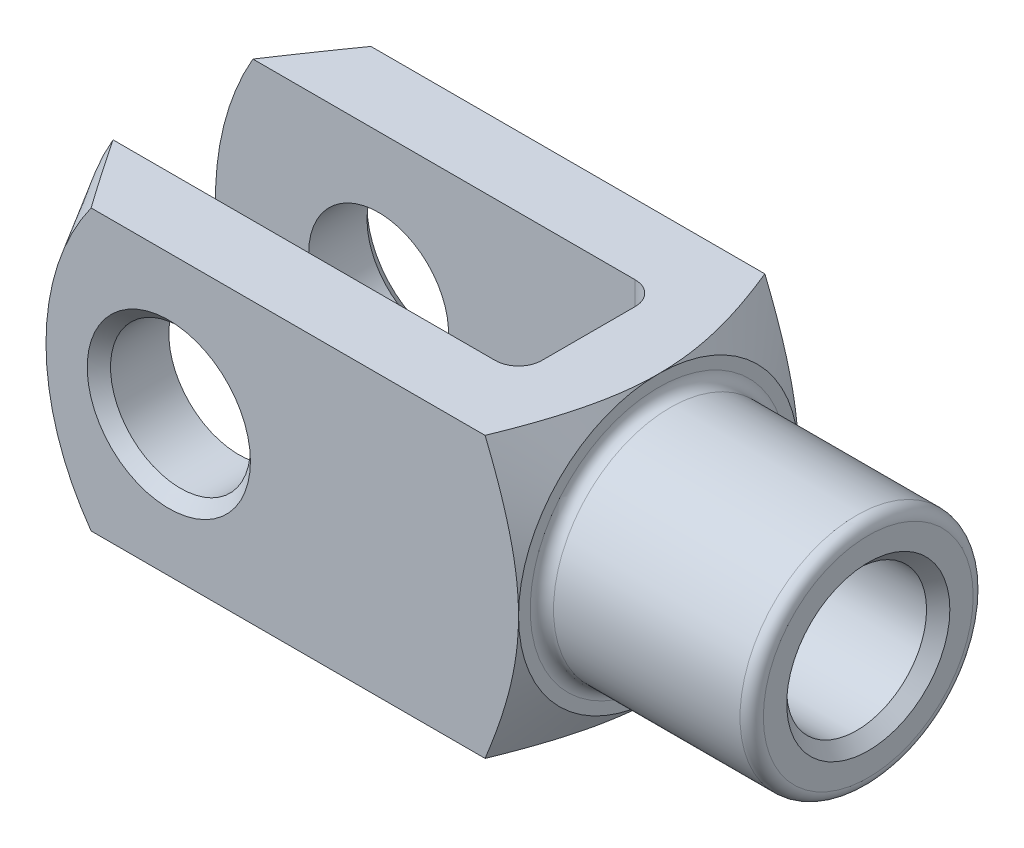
ISO-10303-21;
HEADER;
FILE_DESCRIPTION(('STEP AP214'),'2;1');
FILE_NAME('part.step','',(''),(''),'','','');
FILE_SCHEMA(('AUTOMOTIVE_DESIGN { 1 0 10303 214 1 1 1 1 }'));
ENDSEC;
DATA;
#1=APPLICATION_CONTEXT('core data for automotive mechanical design processes');
#2=APPLICATION_PROTOCOL_DEFINITION('international standard','automotive_design',2000,#1);
#3=PRODUCT_CONTEXT('',#1,'mechanical');
#4=PRODUCT('Part','Part','',(#3));
#5=PRODUCT_RELATED_PRODUCT_CATEGORY('part','',(#4));
#6=PRODUCT_DEFINITION_FORMATION('','',#4);
#7=PRODUCT_DEFINITION_CONTEXT('part definition',#1,'design');
#8=PRODUCT_DEFINITION('design','',#6,#7);
#9=PRODUCT_DEFINITION_SHAPE('','',#8);
#10=(LENGTH_UNIT() NAMED_UNIT(*) SI_UNIT(.MILLI.,.METRE.));
#11=(NAMED_UNIT(*) PLANE_ANGLE_UNIT() SI_UNIT($,.RADIAN.));
#12=(NAMED_UNIT(*) SI_UNIT($,.STERADIAN.) SOLID_ANGLE_UNIT());
#13=UNCERTAINTY_MEASURE_WITH_UNIT(LENGTH_MEASURE(1.E-05),#10,'distance_accuracy_value','');
#14=(GEOMETRIC_REPRESENTATION_CONTEXT(3) GLOBAL_UNCERTAINTY_ASSIGNED_CONTEXT((#13)) GLOBAL_UNIT_ASSIGNED_CONTEXT((#10,
#11,#12)) REPRESENTATION_CONTEXT('',''));
#15=CARTESIAN_POINT('',(0.,0.,0.));
#16=DIRECTION('',(0.,0.,1.));
#17=DIRECTION('',(1.,0.,0.));
#18=AXIS2_PLACEMENT_3D('',#15,#16,#17);
#19=CARTESIAN_POINT('',(-13.,-6.,-2.));
#20=DIRECTION('',(0.,-1.,0.));
#21=DIRECTION('',(0.,0.,-1.));
#22=AXIS2_PLACEMENT_3D('',#19,#20,#21);
#23=CYLINDRICAL_SURFACE('',#22,1.);
#24=DIRECTION('',(0.,1.,0.));
#25=VECTOR('',#24,1.);
#26=CARTESIAN_POINT('',(-12.,-6.,-2.));
#27=LINE('',#26,#25);
#28=CARTESIAN_POINT('',(-12.,-2.23606797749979,-2.));
#29=VERTEX_POINT('',#28);
#30=CARTESIAN_POINT('',(-12.,-6.,-2.));
#31=VERTEX_POINT('',#30);
#32=EDGE_CURVE('E358',#29,#31,#27,.F.);
#33=ORIENTED_EDGE('',*,*,#32,.F.);
#34=CARTESIAN_POINT('',(-12.,-2.23606797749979,-2.));
#35=CARTESIAN_POINT('',(-12.0000045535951,-2.20775625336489,-2.03165904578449));
#36=CARTESIAN_POINT('',(-12.0015027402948,-2.17878644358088,-2.06268973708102));
#37=CARTESIAN_POINT('',(-12.0071675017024,-2.11972302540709,-2.12333658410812));
#38=CARTESIAN_POINT('',(-12.0113306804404,-2.08963089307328,-2.15295448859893));
#39=CARTESIAN_POINT('',(-12.0272653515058,-1.998315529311,-2.23913028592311));
#40=CARTESIAN_POINT('',(-12.042491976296,-1.93561652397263,-2.29349671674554));
#41=CARTESIAN_POINT('',(-12.0924353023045,-1.76515041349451,-2.42955659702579));
#42=CARTESIAN_POINT('',(-12.1333844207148,-1.65483793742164,-2.50573620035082));
#43=CARTESIAN_POINT('',(-12.2281810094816,-1.42878588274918,-2.64123043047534));
#44=CARTESIAN_POINT('',(-12.2821091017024,-1.31301617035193,-2.70043436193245));
#45=CARTESIAN_POINT('',(-12.3826407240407,-1.10989755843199,-2.78870645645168));
#46=CARTESIAN_POINT('',(-12.4273457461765,-1.02322848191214,-2.82159960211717));
#47=CARTESIAN_POINT('',(-12.5198950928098,-0.848750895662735,-2.87889978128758));
#48=CARTESIAN_POINT('',(-12.5677411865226,-0.760941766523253,-2.90330198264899));
#49=CARTESIAN_POINT('',(-12.7141236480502,-0.496880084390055,-2.96406270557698));
#50=CARTESIAN_POINT('',(-12.8158260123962,-0.31936958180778,-2.98823962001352));
#51=CARTESIAN_POINT('',(-12.9435558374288,-0.0977711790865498,-2.99873153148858));
#52=CARTESIAN_POINT('',(-12.9690355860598,-0.0536324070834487,-2.99984541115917));
#53=CARTESIAN_POINT('',(-12.996348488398,-0.00632459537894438,-2.9999949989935));
#54=CARTESIAN_POINT('',(-12.9981742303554,-0.00316231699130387,-2.99999999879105));
#55=CARTESIAN_POINT('',(-13.,0.,-3.));
#56=B_SPLINE_CURVE_WITH_KNOTS('',3,(#34,#35,#36,#37,#38,#39,#40,#41,#42,#43,#44,#45,#46,#47,#48,
#49,#50,#51,#52,#53,#54,#55),.UNSPECIFIED.,.F.,.F.,(4,2,2,2,2,2,2,2,2,2,4),(0.,
0.127332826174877,0.254503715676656,0.506902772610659,0.925130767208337,1.3460269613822,
1.65435422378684,1.9628566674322,2.57763836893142,2.73056489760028,2.74151935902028),.UNSPECIFIED.);
#57=CARTESIAN_POINT('',(-13.,0.,-3.));
#58=VERTEX_POINT('',#57);
#59=EDGE_CURVE('E389',#29,#58,#56,.T.);
#60=ORIENTED_EDGE('',*,*,#59,.T.);
#61=DIRECTION('',(0.,1.,0.));
#62=VECTOR('',#61,1.);
#63=CARTESIAN_POINT('',(-13.,6.,-3.));
#64=LINE('',#63,#62);
#65=CARTESIAN_POINT('',(-13.,-6.,-3.));
#66=VERTEX_POINT('',#65);
#67=EDGE_CURVE('E183',#66,#58,#64,.T.);
#68=ORIENTED_EDGE('',*,*,#67,.F.);
#69=CARTESIAN_POINT('',(-13.,-6.,-2.));
#70=DIRECTION('',(0.,-1.,0.));
#71=DIRECTION('',(0.,0.,-1.));
#72=AXIS2_PLACEMENT_3D('',#69,#70,#71);
#73=CIRCLE('',#72,1.);
#74=EDGE_CURVE('E198',#31,#66,#73,.F.);
#75=ORIENTED_EDGE('',*,*,#74,.F.);
#76=EDGE_LOOP('',(#33,#60,#68,#75));
#77=FACE_BOUND('',#76,.T.);
#78=ADVANCED_FACE('F37',(#77),#23,.F.);
#79=CARTESIAN_POINT('',(-12.,-6.,-3.));
#80=DIRECTION('',(1.,0.,0.));
#81=DIRECTION('',(0.,0.,-1.));
#82=AXIS2_PLACEMENT_3D('',#79,#80,#81);
#83=PLANE('',#82);
#84=CARTESIAN_POINT('',(-12.,6.,-2.));
#85=VERTEX_POINT('',#84);
#86=CARTESIAN_POINT('',(-12.,2.23606797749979,-2.));
#87=VERTEX_POINT('',#86);
#88=EDGE_CURVE('E374',#85,#87,#27,.F.);
#89=ORIENTED_EDGE('',*,*,#88,.T.);
#90=CARTESIAN_POINT('',(-12.,0.,0.));
#91=DIRECTION('',(1.,0.,0.));
#92=DIRECTION('',(0.,0.,-1.));
#93=AXIS2_PLACEMENT_3D('',#90,#91,#92);
#94=CIRCLE('',#93,3.);
#95=CARTESIAN_POINT('',(-12.,2.23606797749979,2.));
#96=VERTEX_POINT('',#95);
#97=EDGE_CURVE('E743',#87,#96,#94,.T.);
#98=ORIENTED_EDGE('',*,*,#97,.T.);
#99=DIRECTION('',(0.,1.,0.));
#100=VECTOR('',#99,1.);
#101=CARTESIAN_POINT('',(-12.,6.,2.));
#102=LINE('',#101,#100);
#103=CARTESIAN_POINT('',(-12.,6.,2.));
#104=VERTEX_POINT('',#103);
#105=EDGE_CURVE('E160',#96,#104,#102,.T.);
#106=ORIENTED_EDGE('',*,*,#105,.T.);
#107=DIRECTION('',(0.,0.,-1.));
#108=VECTOR('',#107,1.);
#109=CARTESIAN_POINT('',(-12.,6.,-3.));
#110=LINE('',#109,#108);
#111=EDGE_CURVE('E338',#104,#85,#110,.T.);
#112=ORIENTED_EDGE('',*,*,#111,.T.);
#113=EDGE_LOOP('',(#89,#98,#106,#112));
#114=FACE_BOUND('',#113,.T.);
#115=ADVANCED_FACE('F464',(#114),#83,.F.);
#116=CARTESIAN_POINT('',(-13.,-6.,2.));
#117=DIRECTION('',(0.,-1.,0.));
#118=DIRECTION('',(0.,0.,-1.));
#119=AXIS2_PLACEMENT_3D('',#116,#117,#118);
#120=CYLINDRICAL_SURFACE('',#119,1.);
#121=ORIENTED_EDGE('',*,*,#105,.F.);
#122=CARTESIAN_POINT('',(-12.,2.23606797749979,2.));
#123=CARTESIAN_POINT('',(-12.0000045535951,2.20775625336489,2.03165904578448));
#124=CARTESIAN_POINT('',(-12.0015027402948,2.17878644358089,2.06268973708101));
#125=CARTESIAN_POINT('',(-12.0071675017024,2.11972302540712,2.12333658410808));
#126=CARTESIAN_POINT('',(-12.0113306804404,2.08963089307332,2.15295448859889));
#127=CARTESIAN_POINT('',(-12.0272653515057,1.99831552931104,2.23913028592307));
#128=CARTESIAN_POINT('',(-12.0424919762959,1.93561652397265,2.29349671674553));
#129=CARTESIAN_POINT('',(-12.0924353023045,1.76515041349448,2.42955659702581));
#130=CARTESIAN_POINT('',(-12.1333844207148,1.65483793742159,2.50573620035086));
#131=CARTESIAN_POINT('',(-12.2281810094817,1.42878588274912,2.64123043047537));
#132=CARTESIAN_POINT('',(-12.2821091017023,1.31301617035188,2.70043436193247));
#133=CARTESIAN_POINT('',(-12.3826407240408,1.109897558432,2.78870645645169));
#134=CARTESIAN_POINT('',(-12.4273457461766,1.02322848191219,2.82159960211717));
#135=CARTESIAN_POINT('',(-12.5198950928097,0.848750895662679,2.87889978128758));
#136=CARTESIAN_POINT('',(-12.5677411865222,0.760941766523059,2.90330198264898));
#137=CARTESIAN_POINT('',(-12.7141236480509,0.496880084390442,2.96406270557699));
#138=CARTESIAN_POINT('',(-12.8158260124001,0.319369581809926,2.98823962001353));
#139=CARTESIAN_POINT('',(-12.9435558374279,0.0977711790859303,2.99873153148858));
#140=CARTESIAN_POINT('',(-12.9690355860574,0.0536324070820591,2.99984541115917));
#141=CARTESIAN_POINT('',(-12.9963484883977,0.00632459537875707,2.9999949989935));
#142=CARTESIAN_POINT('',(-12.9981742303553,0.00316231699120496,2.99999999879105));
#143=CARTESIAN_POINT('',(-13.,0.,3.));
#144=B_SPLINE_CURVE_WITH_KNOTS('',3,(#122,#123,#124,#125,#126,#127,#128,#129,#130,#131,#132,
#133,#134,#135,#136,#137,#138,#139,#140,#141,#142,#143),.UNSPECIFIED.,.F.,.F.,(4,2,2,2,2,2,2,2,
2,2,4),(0.,0.127332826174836,0.254503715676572,0.506902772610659,0.925130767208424,
1.3460269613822,1.65435422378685,1.96285666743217,2.57763836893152,2.73056489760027,
2.74151935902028),.UNSPECIFIED.);
#145=CARTESIAN_POINT('',(-13.,0.,3.));
#146=VERTEX_POINT('',#145);
#147=EDGE_CURVE('E145',#96,#146,#144,.T.);
#148=ORIENTED_EDGE('',*,*,#147,.T.);
#149=DIRECTION('',(0.,1.,0.));
#150=VECTOR('',#149,1.);
#151=CARTESIAN_POINT('',(-13.,-6.,3.));
#152=LINE('',#151,#150);
#153=CARTESIAN_POINT('',(-13.,6.,3.));
#154=VERTEX_POINT('',#153);
#155=EDGE_CURVE('E159',#154,#146,#152,.F.);
#156=ORIENTED_EDGE('',*,*,#155,.F.);
#157=CARTESIAN_POINT('',(-13.,6.,2.));
#158=DIRECTION('',(0.,1.,0.));
#159=DIRECTION('',(0.,0.,1.));
#160=AXIS2_PLACEMENT_3D('',#157,#158,#159);
#161=CIRCLE('',#160,1.);
#162=EDGE_CURVE('E190',#104,#154,#161,.F.);
#163=ORIENTED_EDGE('',*,*,#162,.F.);
#164=EDGE_LOOP('',(#121,#148,#156,#163));
#165=FACE_BOUND('',#164,.T.);
#166=ADVANCED_FACE('F156',(#165),#120,.F.);
#167=CARTESIAN_POINT('',(-31.,-6.,-3.));
#168=DIRECTION('',(0.,0.,-1.));
#169=DIRECTION('',(-1.,0.,0.));
#170=AXIS2_PLACEMENT_3D('',#167,#168,#169);
#171=PLANE('',#170);
#172=CARTESIAN_POINT('',(-24.,0.,-3.));
#173=DIRECTION('',(0.,0.,-1.));
#174=DIRECTION('',(-1.,0.,0.));
#175=AXIS2_PLACEMENT_3D('',#172,#173,#174);
#176=CIRCLE('',#175,3.);
#177=CARTESIAN_POINT('',(-27.,0.,-3.));
#178=VERTEX_POINT('',#177);
#179=EDGE_CURVE('E368',#178,#178,#176,.F.);
#180=ORIENTED_EDGE('',*,*,#179,.F.);
#181=EDGE_LOOP('',(#180));
#182=FACE_BOUND('',#181,.T.);
#183=CARTESIAN_POINT('',(-19.,0.,-3.));
#184=DIRECTION('',(0.,0.,1.));
#185=DIRECTION('',(1.,0.,0.));
#186=AXIS2_PLACEMENT_3D('',#183,#184,#185);
#187=CIRCLE('',#186,12.);
#188=CARTESIAN_POINT('',(-29.3923048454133,6.,-3.));
#189=VERTEX_POINT('',#188);
#190=CARTESIAN_POINT('',(-29.3923048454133,-6.,-3.));
#191=VERTEX_POINT('',#190);
#192=EDGE_CURVE('E277',#189,#191,#187,.T.);
#193=ORIENTED_EDGE('',*,*,#192,.T.);
#194=DIRECTION('',(-1.,0.,0.));
#195=VECTOR('',#194,1.);
#196=CARTESIAN_POINT('',(-31.,-6.,-3.));
#197=LINE('',#196,#195);
#198=EDGE_CURVE('E333',#66,#191,#197,.T.);
#199=ORIENTED_EDGE('',*,*,#198,.F.);
#200=ORIENTED_EDGE('',*,*,#67,.T.);
#201=CARTESIAN_POINT('',(-13.,6.,-3.));
#202=VERTEX_POINT('',#201);
#203=EDGE_CURVE('E179',#58,#202,#64,.T.);
#204=ORIENTED_EDGE('',*,*,#203,.T.);
#205=DIRECTION('',(-1.,0.,0.));
#206=VECTOR('',#205,1.);
#207=CARTESIAN_POINT('',(-31.,6.,-3.));
#208=LINE('',#207,#206);
#209=EDGE_CURVE('E346',#202,#189,#208,.T.);
#210=ORIENTED_EDGE('',*,*,#209,.T.);
#211=EDGE_LOOP('',(#193,#199,#200,#204,#210));
#212=FACE_BOUND('',#211,.T.);
#213=ADVANCED_FACE('F392',(#182,#212),#171,.F.);
#214=CARTESIAN_POINT('',(-31.,-6.,3.));
#215=DIRECTION('',(0.,0.,1.));
#216=DIRECTION('',(1.,0.,0.));
#217=AXIS2_PLACEMENT_3D('',#214,#215,#216);
#218=PLANE('',#217);
#219=CARTESIAN_POINT('',(-24.,0.,3.));
#220=DIRECTION('',(0.,0.,1.));
#221=DIRECTION('',(1.,0.,0.));
#222=AXIS2_PLACEMENT_3D('',#219,#220,#221);
#223=CIRCLE('',#222,3.);
#224=CARTESIAN_POINT('',(-21.,0.,3.));
#225=VERTEX_POINT('',#224);
#226=EDGE_CURVE('E345',#225,#225,#223,.F.);
#227=ORIENTED_EDGE('',*,*,#226,.F.);
#228=EDGE_LOOP('',(#227));
#229=FACE_BOUND('',#228,.T.);
#230=DIRECTION('',(1.,0.,0.));
#231=VECTOR('',#230,1.);
#232=CARTESIAN_POINT('',(-31.,-6.,3.));
#233=LINE('',#232,#231);
#234=CARTESIAN_POINT('',(-29.3923048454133,-6.,3.));
#235=VERTEX_POINT('',#234);
#236=CARTESIAN_POINT('',(-13.,-6.,3.));
#237=VERTEX_POINT('',#236);
#238=EDGE_CURVE('E337',#235,#237,#233,.T.);
#239=ORIENTED_EDGE('',*,*,#238,.F.);
#240=CARTESIAN_POINT('',(-19.,0.,3.));
#241=DIRECTION('',(0.,0.,1.));
#242=DIRECTION('',(1.,0.,0.));
#243=AXIS2_PLACEMENT_3D('',#240,#241,#242);
#244=CIRCLE('',#243,12.);
#245=CARTESIAN_POINT('',(-29.3923048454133,6.,3.));
#246=VERTEX_POINT('',#245);
#247=EDGE_CURVE('E419',#246,#235,#244,.T.);
#248=ORIENTED_EDGE('',*,*,#247,.F.);
#249=DIRECTION('',(1.,0.,0.));
#250=VECTOR('',#249,1.);
#251=CARTESIAN_POINT('',(-31.,6.,3.));
#252=LINE('',#251,#250);
#253=EDGE_CURVE('E176',#246,#154,#252,.T.);
#254=ORIENTED_EDGE('',*,*,#253,.T.);
#255=ORIENTED_EDGE('',*,*,#155,.T.);
#256=EDGE_CURVE('E164',#146,#237,#152,.F.);
#257=ORIENTED_EDGE('',*,*,#256,.T.);
#258=EDGE_LOOP('',(#239,#248,#254,#255,#257));
#259=FACE_BOUND('',#258,.T.);
#260=ADVANCED_FACE('F173',(#229,#259),#218,.F.);
#261=CARTESIAN_POINT('',(-31.,-6.,6.));
#262=DIRECTION('',(0.,0.,1.));
#263=DIRECTION('',(1.,0.,0.));
#264=AXIS2_PLACEMENT_3D('',#261,#262,#263);
#265=PLANE('',#264);
#266=CARTESIAN_POINT('',(-24.,0.,6.));
#267=DIRECTION('',(0.,0.,1.));
#268=DIRECTION('',(1.,0.,0.));
#269=AXIS2_PLACEMENT_3D('',#266,#267,#268);
#270=CIRCLE('',#269,3.5);
#271=CARTESIAN_POINT('',(-20.5,0.,6.));
#272=VERTEX_POINT('',#271);
#273=EDGE_CURVE('E229',#272,#272,#270,.F.);
#274=ORIENTED_EDGE('',*,*,#273,.T.);
#275=EDGE_LOOP('',(#274));
#276=FACE_BOUND('',#275,.T.);
#277=DIRECTION('',(1.,0.,0.));
#278=VECTOR('',#277,1.);
#279=CARTESIAN_POINT('',(-31.,6.,6.));
#280=LINE('',#279,#278);
#281=CARTESIAN_POINT('',(-27.3325134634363,6.,6.));
#282=VERTEX_POINT('',#281);
#283=CARTESIAN_POINT('',(-10.4348778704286,6.,6.));
#284=VERTEX_POINT('',#283);
#285=EDGE_CURVE('E365',#282,#284,#280,.T.);
#286=ORIENTED_EDGE('',*,*,#285,.F.);
#287=CARTESIAN_POINT('',(-19.,0.,6.));
#288=DIRECTION('',(0.,0.,1.));
#289=DIRECTION('',(1.,0.,0.));
#290=AXIS2_PLACEMENT_3D('',#287,#288,#289);
#291=CIRCLE('',#290,10.2679491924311);
#292=CARTESIAN_POINT('',(-27.3325134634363,-6.,6.));
#293=VERTEX_POINT('',#292);
#294=EDGE_CURVE('E61',#282,#293,#291,.T.);
#295=ORIENTED_EDGE('',*,*,#294,.T.);
#296=DIRECTION('',(1.,0.,0.));
#297=VECTOR('',#296,1.);
#298=CARTESIAN_POINT('',(-31.,-6.,6.));
#299=LINE('',#298,#297);
#300=CARTESIAN_POINT('',(-10.4348778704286,-6.,6.));
#301=VERTEX_POINT('',#300);
#302=EDGE_CURVE('E362',#293,#301,#299,.T.);
#303=ORIENTED_EDGE('',*,*,#302,.T.);
#304=CARTESIAN_POINT('',(-13.4135240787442,-12.2544261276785,6.));
#305=CARTESIAN_POINT('',(-13.260207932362,-11.9587102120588,6.));
#306=CARTESIAN_POINT('',(-13.1077023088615,-11.6625701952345,6.));
#307=CARTESIAN_POINT('',(-12.8047419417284,-11.0692236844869,6.));
#308=CARTESIAN_POINT('',(-12.6542873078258,-10.7720171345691,6.));
#309=CARTESIAN_POINT('',(-12.3556153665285,-10.1758321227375,6.));
#310=CARTESIAN_POINT('',(-12.2074024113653,-9.87685147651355,6.));
#311=CARTESIAN_POINT('',(-11.9140958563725,-9.27736809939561,6.));
#312=CARTESIAN_POINT('',(-11.7690022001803,-8.97686539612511,6.));
#313=CARTESIAN_POINT('',(-11.4739226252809,-8.35545095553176,6.));
#314=CARTESIAN_POINT('',(-11.3241849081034,-8.03442101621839,6.));
#315=CARTESIAN_POINT('',(-11.0304086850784,-7.38973252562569,6.));
#316=CARTESIAN_POINT('',(-10.886370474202,-7.06607383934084,6.));
#317=CARTESIAN_POINT('',(-10.6058683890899,-6.41564861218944,6.));
#318=CARTESIAN_POINT('',(-10.4694011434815,-6.08888353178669,6.));
#319=CARTESIAN_POINT('',(-10.2064860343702,-5.43134466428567,6.));
#320=CARTESIAN_POINT('',(-10.0800369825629,-5.10057135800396,6.));
#321=CARTESIAN_POINT('',(-9.88755181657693,-4.56461982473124,6.));
#322=CARTESIAN_POINT('',(-9.81724725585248,-4.36097670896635,6.));
#323=CARTESIAN_POINT('',(-9.68269100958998,-3.95170680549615,6.));
#324=CARTESIAN_POINT('',(-9.61843880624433,-3.74608018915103,6.));
#325=CARTESIAN_POINT('',(-9.49717598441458,-3.33269266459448,6.));
#326=CARTESIAN_POINT('',(-9.44016521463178,-3.12493180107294,6.));
#327=CARTESIAN_POINT('',(-9.3347478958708,-2.70722081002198,6.));
#328=CARTESIAN_POINT('',(-9.28634125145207,-2.49727070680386,6.));
#329=CARTESIAN_POINT('',(-9.20060957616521,-2.08023423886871,6.));
#330=CARTESIAN_POINT('',(-9.16305108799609,-1.87319634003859,6.));
#331=CARTESIAN_POINT('',(-9.098854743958,-1.45741996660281,6.));
#332=CARTESIAN_POINT('',(-9.07221653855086,-1.24868154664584,6.));
#333=CARTESIAN_POINT('',(-9.03097423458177,-0.830141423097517,6.));
#334=CARTESIAN_POINT('',(-9.01636227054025,-0.620340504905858,6.));
#335=CARTESIAN_POINT('',(-8.99981707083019,-0.20023728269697,6.));
#336=CARTESIAN_POINT('',(-8.99788339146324,0.0100650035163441,6.));
#337=CARTESIAN_POINT('',(-9.00645771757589,0.415074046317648,6.));
#338=CARTESIAN_POINT('',(-9.01606940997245,0.609800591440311,6.));
#339=CARTESIAN_POINT('',(-9.04587321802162,0.998433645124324,6.));
#340=CARTESIAN_POINT('',(-9.06606530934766,1.19234015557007,6.));
#341=CARTESIAN_POINT('',(-9.11628968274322,1.57896183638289,6.));
#342=CARTESIAN_POINT('',(-9.14632704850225,1.77167633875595,6.));
#343=CARTESIAN_POINT('',(-9.2152516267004,2.1555059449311,6.));
#344=CARTESIAN_POINT('',(-9.25413908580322,2.34662100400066,6.));
#345=CARTESIAN_POINT('',(-9.34092007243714,2.73259717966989,6.));
#346=CARTESIAN_POINT('',(-9.38904169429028,2.92740661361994,6.));
#347=CARTESIAN_POINT('',(-9.49234908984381,3.31513101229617,6.));
#348=CARTESIAN_POINT('',(-9.54753493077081,3.50804595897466,6.));
#349=CARTESIAN_POINT('',(-9.66390260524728,3.89203886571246,6.));
#350=CARTESIAN_POINT('',(-9.72508417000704,4.08311690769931,6.));
#351=CARTESIAN_POINT('',(-9.85250790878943,4.46355855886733,6.));
#352=CARTESIAN_POINT('',(-9.91874981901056,4.65292225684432,6.));
#353=CARTESIAN_POINT('',(-10.0610705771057,5.04546937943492,6.));
#354=CARTESIAN_POINT('',(-10.1375111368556,5.24852125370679,6.));
#355=CARTESIAN_POINT('',(-10.2945475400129,5.65301574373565,6.));
#356=CARTESIAN_POINT('',(-10.3751435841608,5.85445828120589,6.));
#357=CARTESIAN_POINT('',(-10.6221320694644,6.45674423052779,6.));
#358=CARTESIAN_POINT('',(-10.7936954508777,6.8554666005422,6.));
#359=CARTESIAN_POINT('',(-11.146659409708,7.64890048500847,6.));
#360=CARTESIAN_POINT('',(-11.3280684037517,8.0436082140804,6.));
#361=CARTESIAN_POINT('',(-11.6979069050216,8.82965921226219,6.));
#362=CARTESIAN_POINT('',(-11.886335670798,9.22100283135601,6.));
#363=CARTESIAN_POINT('',(-12.2689881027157,10.0023172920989,6.));
#364=CARTESIAN_POINT('',(-12.463227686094,10.3922803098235,6.));
#365=CARTESIAN_POINT('',(-12.8556839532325,11.1702067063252,6.));
#366=CARTESIAN_POINT('',(-13.053900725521,11.5581700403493,6.));
#367=CARTESIAN_POINT('',(-13.4533033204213,12.3323174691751,6.));
#368=CARTESIAN_POINT('',(-13.6544876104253,12.718502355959,6.));
#369=CARTESIAN_POINT('',(-14.0592727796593,13.4896043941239,6.));
#370=CARTESIAN_POINT('',(-14.2628736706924,13.8745215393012,6.));
#371=CARTESIAN_POINT('',(-14.8157959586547,14.9135601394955,6.));
#372=CARTESIAN_POINT('',(-15.1669414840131,15.5667104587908,6.));
#373=CARTESIAN_POINT('',(-15.8731950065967,16.8709801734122,6.));
#374=CARTESIAN_POINT('',(-16.2283035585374,17.522099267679,6.));
#375=CARTESIAN_POINT('',(-16.9393356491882,18.8190448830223,6.));
#376=CARTESIAN_POINT('',(-17.2952428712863,19.4648803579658,6.));
#377=CARTESIAN_POINT('',(-18.0091689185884,20.755250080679,6.));
#378=CARTESIAN_POINT('',(-18.3671874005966,21.3997845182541,6.));
#379=CARTESIAN_POINT('',(-18.725961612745,22.0438949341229,6.));
#380=B_SPLINE_CURVE_WITH_KNOTS('',3,(#304,#305,#306,#307,#308,#309,#310,#311,#312,#313,#314,
#315,#316,#317,#318,#319,#320,#321,#322,#323,#324,#325,#326,#327,#328,#329,#330,#331,#332,#333,
#334,#335,#336,#337,#338,#339,#340,#341,#342,#343,#344,#345,#346,#347,#348,#349,#350,#351,#352,
#353,#354,#355,#356,#357,#358,#359,#360,#361,#362,#363,#364,#365,#366,#367,#368,#369,#370,#371,
#372,#373,#374,#375,#376,#377,#378,#379),.UNSPECIFIED.,.F.,.F.,(4,2,2,2,2,2,2,2,2,2,2,2,2,2,2,2,
2,2,2,2,2,2,2,2,2,2,2,2,2,2,2,2,2,2,2,2,2,4),(0.,0.999295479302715,1.99864421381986,
2.99973317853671,4.00080403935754,5.06346356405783,6.12617801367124,7.18841537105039,
8.25052654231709,8.89676374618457,9.54294561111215,10.1891139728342,10.8352751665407,
11.4662683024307,12.0972412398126,12.7278011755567,13.3583390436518,13.9429319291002,
14.5275234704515,15.1124173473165,15.6973275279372,16.2991674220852,16.9010130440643,
17.5028316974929,18.1046189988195,18.7554539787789,19.4063204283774,20.7083071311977,
22.0114249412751,23.3144055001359,24.6213589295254,25.9283414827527,27.2346711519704,
28.5410072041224,30.7656602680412,32.9906287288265,35.2028538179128,37.4147287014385),.UNSPECIFIED.);
#381=CARTESIAN_POINT('',(-9.,0.,6.));
#382=VERTEX_POINT('',#381);
#383=EDGE_CURVE('E306',#382,#301,#380,.F.);
#384=ORIENTED_EDGE('',*,*,#383,.F.);
#385=EDGE_CURVE('E304',#284,#382,#380,.F.);
#386=ORIENTED_EDGE('',*,*,#385,.F.);
#387=EDGE_LOOP('',(#286,#295,#303,#384,#386));
#388=FACE_BOUND('',#387,.T.);
#389=ADVANCED_FACE('F288',(#276,#388),#265,.T.);
#390=CARTESIAN_POINT('',(-31.,-6.,6.));
#391=DIRECTION('',(0.,-1.,0.));
#392=DIRECTION('',(0.,0.,-1.));
#393=AXIS2_PLACEMENT_3D('',#390,#391,#392);
#394=PLANE('',#393);
#395=ORIENTED_EDGE('',*,*,#198,.T.);
#396=CARTESIAN_POINT('',(-34.1393635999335,-6.,4.42179012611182));
#397=CARTESIAN_POINT('',(-33.8474254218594,-6.,3.95174312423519));
#398=CARTESIAN_POINT('',(-33.5546877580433,-6.,3.48219040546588));
#399=CARTESIAN_POINT('',(-32.9672392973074,-6.,2.54430803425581));
#400=CARTESIAN_POINT('',(-32.6725284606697,-6.,2.0759784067));
#401=CARTESIAN_POINT('',(-32.0804179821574,-6.,1.14023742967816));
#402=CARTESIAN_POINT('',(-31.7830155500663,-6.,0.672827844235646));
#403=CARTESIAN_POINT('',(-31.1853697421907,-6.,-0.26016739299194));
#404=CARTESIAN_POINT('',(-30.8851263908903,-6.,-0.725753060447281));
#405=CARTESIAN_POINT('',(-30.2685694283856,-6.,-1.67399892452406));
#406=CARTESIAN_POINT('',(-29.9521073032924,-6.,-2.15656267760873));
#407=CARTESIAN_POINT('',(-29.3144057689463,-6.,-3.11852313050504));
#408=CARTESIAN_POINT('',(-28.9931664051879,-6.,-3.59791986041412));
#409=CARTESIAN_POINT('',(-28.3447668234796,-6.,-4.5521799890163));
#410=CARTESIAN_POINT('',(-28.0176111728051,-6.,-5.02704648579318));
#411=CARTESIAN_POINT('',(-27.3552026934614,-6.,-5.97109163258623));
#412=CARTESIAN_POINT('',(-27.0199503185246,-6.,-6.44027059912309));
#413=CARTESIAN_POINT('',(-26.5103377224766,-6.,-7.13578360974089));
#414=CARTESIAN_POINT('',(-26.3401620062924,-6.,-7.3651834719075));
#415=CARTESIAN_POINT('',(-25.9965727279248,-6.,-7.82154235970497));
#416=CARTESIAN_POINT('',(-25.823159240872,-6.,-8.04850144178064));
#417=CARTESIAN_POINT('',(-25.4722215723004,-6.,-8.49973386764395));
#418=CARTESIAN_POINT('',(-25.2946919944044,-6.,-8.72400302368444));
#419=CARTESIAN_POINT('',(-24.9349539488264,-6.,-9.16874891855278));
#420=CARTESIAN_POINT('',(-24.7527457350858,-6.,-9.38922586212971));
#421=CARTESIAN_POINT('',(-24.3845109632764,-6.,-9.823063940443));
#422=CARTESIAN_POINT('',(-24.1985436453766,-6.,-10.0364751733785));
#423=CARTESIAN_POINT('',(-23.8195986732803,-6.,-10.4571181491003));
#424=CARTESIAN_POINT('',(-23.6266192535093,-6.,-10.6643483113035));
#425=CARTESIAN_POINT('',(-23.2323728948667,-6.,-11.0699097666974));
#426=CARTESIAN_POINT('',(-23.0311255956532,-6.,-11.2682600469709));
#427=CARTESIAN_POINT('',(-22.6177115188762,-6.,-11.6531576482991));
#428=CARTESIAN_POINT('',(-22.4055521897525,-6.,-11.8397128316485));
#429=CARTESIAN_POINT('',(-22.0729884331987,-6.,-12.1098556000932));
#430=CARTESIAN_POINT('',(-21.9576788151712,-6.,-12.1997112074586));
#431=CARTESIAN_POINT('',(-21.7228111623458,-6.,-12.3737716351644));
#432=CARTESIAN_POINT('',(-21.6032522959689,-6.,-12.4579753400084));
#433=CARTESIAN_POINT('',(-21.3595319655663,-6.,-12.6192969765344));
#434=CARTESIAN_POINT('',(-21.2353742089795,-6.,-12.6964204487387));
#435=CARTESIAN_POINT('',(-20.982078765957,-6.,-12.8418949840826));
#436=CARTESIAN_POINT('',(-20.8529423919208,-6.,-12.9102483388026));
#437=CARTESIAN_POINT('',(-20.5176686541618,-6.,-13.0703365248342));
#438=CARTESIAN_POINT('',(-20.3077768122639,-6.,-13.1546285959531));
#439=CARTESIAN_POINT('',(-19.9849826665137,-6.,-13.2547999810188));
#440=CARTESIAN_POINT('',(-19.876088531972,-6.,-13.2838084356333));
#441=CARTESIAN_POINT('',(-19.6561770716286,-6.,-13.3320457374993));
#442=CARTESIAN_POINT('',(-19.5451609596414,-6.,-13.3512800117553));
#443=CARTESIAN_POINT('',(-19.3206486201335,-6.,-13.3793003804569));
#444=CARTESIAN_POINT('',(-19.2071386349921,-6.,-13.3879773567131));
#445=CARTESIAN_POINT('',(-18.9798158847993,-6.,-13.394110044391));
#446=CARTESIAN_POINT('',(-18.8660031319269,-6.,-13.3915662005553));
#447=CARTESIAN_POINT('',(-18.6391561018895,-6.,-13.3753792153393));
#448=CARTESIAN_POINT('',(-18.5261219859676,-6.,-13.361733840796));
#449=CARTESIAN_POINT('',(-18.3018245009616,-6.,-13.3239722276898));
#450=CARTESIAN_POINT('',(-18.1905614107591,-6.,-13.2998543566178));
#451=CARTESIAN_POINT('',(-17.9501565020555,-6.,-13.2367814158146));
#452=CARTESIAN_POINT('',(-17.8215207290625,-6.,-13.1959054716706));
#453=CARTESIAN_POINT('',(-17.5684335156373,-6.,-13.1027470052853));
#454=CARTESIAN_POINT('',(-17.443984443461,-6.,-13.050458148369));
#455=CARTESIAN_POINT('',(-17.1991880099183,-6.,-12.9362481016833));
#456=CARTESIAN_POINT('',(-17.07885370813,-6.,-12.8742991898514));
#457=CARTESIAN_POINT('',(-16.8425871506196,-6.,-12.7426097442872));
#458=CARTESIAN_POINT('',(-16.7266544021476,-6.,-12.6728700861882));
#459=CARTESIAN_POINT('',(-16.4615159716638,-6.,-12.5031033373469));
#460=CARTESIAN_POINT('',(-16.3138719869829,-6.,-12.4006458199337));
#461=CARTESIAN_POINT('',(-16.0249232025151,-6.,-12.1871088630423));
#462=CARTESIAN_POINT('',(-15.8836214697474,-6.,-12.076025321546));
#463=CARTESIAN_POINT('',(-15.6062884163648,-6.,-11.8469719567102));
#464=CARTESIAN_POINT('',(-15.470267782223,-6.,-11.7289892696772));
#465=CARTESIAN_POINT('',(-15.2030263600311,-6.,-11.4877793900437));
#466=CARTESIAN_POINT('',(-15.0718047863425,-6.,-11.3645530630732));
#467=CARTESIAN_POINT('',(-14.8125971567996,-6.,-11.1130582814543));
#468=CARTESIAN_POINT('',(-14.6846384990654,-6.,-10.9847616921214));
#469=CARTESIAN_POINT('',(-14.4322872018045,-6.,-10.7247007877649));
#470=CARTESIAN_POINT('',(-14.3078948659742,-6.,-10.5929361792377));
#471=CARTESIAN_POINT('',(-13.9395885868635,-6.,-10.1936988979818));
#472=CARTESIAN_POINT('',(-13.7002559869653,-6.,-9.92199665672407));
#473=CARTESIAN_POINT('',(-13.2996709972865,-6.,-9.45153467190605));
#474=CARTESIAN_POINT('',(-13.1360902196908,-6.,-9.25473181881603));
#475=CARTESIAN_POINT('',(-12.8127787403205,-6.,-8.8579216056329));
#476=CARTESIAN_POINT('',(-12.65304880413,-6.,-8.65791362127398));
#477=CARTESIAN_POINT('',(-12.3392735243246,-6.,-8.25842615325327));
#478=CARTESIAN_POINT('',(-12.1851785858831,-6.,-8.05898548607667));
#479=CARTESIAN_POINT('',(-11.8797491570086,-6.,-7.65809556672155));
#480=CARTESIAN_POINT('',(-11.7284138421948,-6.,-7.45664694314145));
#481=CARTESIAN_POINT('',(-11.5782098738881,-6.,-7.25436752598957));
#482=B_SPLINE_CURVE_WITH_KNOTS('',3,(#396,#397,#398,#399,#400,#401,#402,#403,#404,#405,#406,
#407,#408,#409,#410,#411,#412,#413,#414,#415,#416,#417,#418,#419,#420,#421,#422,#423,#424,#425,
#426,#427,#428,#429,#430,#431,#432,#433,#434,#435,#436,#437,#438,#439,#440,#441,#442,#443,#444,
#445,#446,#447,#448,#449,#450,#451,#452,#453,#454,#455,#456,#457,#458,#459,#460,#461,#462,#463,
#464,#465,#466,#467,#468,#469,#470,#471,#472,#473,#474,#475,#476,#477,#478,#479,#480,#481),
.UNSPECIFIED.,.F.,.F.,(4,2,2,2,2,2,2,2,2,2,2,2,2,2,2,2,2,2,2,2,2,2,2,2,2,2,2,2,2,2,2,2,2,2,2,2,
2,2,2,2,2,2,4),(0.,1.65998663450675,3.32000678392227,4.98200894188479,6.64399678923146,
8.37520151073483,10.1063897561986,11.8362942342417,13.5661019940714,14.4229674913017,
15.2798131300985,16.137853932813,16.9958482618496,17.8449395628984,18.6942461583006,
19.5416403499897,20.3884636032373,20.8268856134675,21.2653939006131,21.7035560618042,
22.1416034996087,22.8173812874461,23.1550908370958,23.4926126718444,23.8335942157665,
24.1745622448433,24.5155988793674,24.8566886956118,25.2609625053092,25.6654612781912,
26.071142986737,26.4767791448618,27.0154896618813,27.554457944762,28.0944653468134,
28.6343839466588,29.1779015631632,29.7214653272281,30.8073733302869,31.5750640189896,
32.3429060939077,33.0989888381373,33.8548418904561),.UNSPECIFIED.);
#483=CARTESIAN_POINT('',(-27.3325134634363,-6.,-6.));
#484=VERTEX_POINT('',#483);
#485=EDGE_CURVE('E276',#191,#484,#482,.T.);
#486=ORIENTED_EDGE('',*,*,#485,.T.);
#487=DIRECTION('',(1.,0.,0.));
#488=VECTOR('',#487,1.);
#489=CARTESIAN_POINT('',(-31.,-6.,-6.));
#490=LINE('',#489,#488);
#491=CARTESIAN_POINT('',(-10.4348778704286,-6.,-6.));
#492=VERTEX_POINT('',#491);
#493=EDGE_CURVE('E359',#484,#492,#490,.T.);
#494=ORIENTED_EDGE('',*,*,#493,.T.);
#495=CARTESIAN_POINT('',(-13.4135240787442,-6.,-12.2544261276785));
#496=CARTESIAN_POINT('',(-13.260207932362,-6.,-11.9587102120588));
#497=CARTESIAN_POINT('',(-13.1077023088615,-6.,-11.6625701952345));
#498=CARTESIAN_POINT('',(-12.8047419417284,-6.,-11.0692236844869));
#499=CARTESIAN_POINT('',(-12.6542873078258,-6.,-10.7720171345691));
#500=CARTESIAN_POINT('',(-12.3556153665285,-6.,-10.1758321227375));
#501=CARTESIAN_POINT('',(-12.2074024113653,-6.,-9.87685147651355));
#502=CARTESIAN_POINT('',(-11.9140958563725,-6.,-9.27736809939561));
#503=CARTESIAN_POINT('',(-11.7690022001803,-6.,-8.97686539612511));
#504=CARTESIAN_POINT('',(-11.4739226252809,-6.,-8.35545095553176));
#505=CARTESIAN_POINT('',(-11.3241849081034,-6.,-8.03442101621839));
#506=CARTESIAN_POINT('',(-11.0304086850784,-6.,-7.38973252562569));
#507=CARTESIAN_POINT('',(-10.886370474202,-6.,-7.06607383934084));
#508=CARTESIAN_POINT('',(-10.6058683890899,-6.,-6.41564861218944));
#509=CARTESIAN_POINT('',(-10.4694011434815,-6.,-6.08888353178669));
#510=CARTESIAN_POINT('',(-10.2064860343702,-6.,-5.43134466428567));
#511=CARTESIAN_POINT('',(-10.0800369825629,-6.,-5.10057135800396));
#512=CARTESIAN_POINT('',(-9.88755181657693,-6.,-4.56461982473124));
#513=CARTESIAN_POINT('',(-9.81724725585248,-6.,-4.36097670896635));
#514=CARTESIAN_POINT('',(-9.68269100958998,-6.,-3.95170680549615));
#515=CARTESIAN_POINT('',(-9.61843880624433,-6.,-3.74608018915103));
#516=CARTESIAN_POINT('',(-9.49717598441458,-6.,-3.33269266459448));
#517=CARTESIAN_POINT('',(-9.44016521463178,-6.,-3.12493180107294));
#518=CARTESIAN_POINT('',(-9.3347478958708,-6.,-2.70722081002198));
#519=CARTESIAN_POINT('',(-9.28634125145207,-6.,-2.49727070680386));
#520=CARTESIAN_POINT('',(-9.20060957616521,-6.,-2.08023423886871));
#521=CARTESIAN_POINT('',(-9.16305108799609,-6.,-1.87319634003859));
#522=CARTESIAN_POINT('',(-9.098854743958,-6.,-1.45741996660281));
#523=CARTESIAN_POINT('',(-9.07221653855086,-6.,-1.24868154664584));
#524=CARTESIAN_POINT('',(-9.03097423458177,-6.,-0.830141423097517));
#525=CARTESIAN_POINT('',(-9.01636227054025,-6.,-0.620340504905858));
#526=CARTESIAN_POINT('',(-8.99981707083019,-6.,-0.20023728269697));
#527=CARTESIAN_POINT('',(-8.99788339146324,-6.,0.0100650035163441));
#528=CARTESIAN_POINT('',(-9.00645771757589,-6.,0.415074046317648));
#529=CARTESIAN_POINT('',(-9.01606940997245,-6.,0.609800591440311));
#530=CARTESIAN_POINT('',(-9.04587321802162,-6.,0.998433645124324));
#531=CARTESIAN_POINT('',(-9.06606530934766,-6.,1.19234015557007));
#532=CARTESIAN_POINT('',(-9.11628968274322,-6.,1.57896183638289));
#533=CARTESIAN_POINT('',(-9.14632704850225,-6.,1.77167633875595));
#534=CARTESIAN_POINT('',(-9.2152516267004,-6.,2.1555059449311));
#535=CARTESIAN_POINT('',(-9.25413908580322,-6.,2.34662100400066));
#536=CARTESIAN_POINT('',(-9.34092007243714,-6.,2.73259717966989));
#537=CARTESIAN_POINT('',(-9.38904169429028,-6.,2.92740661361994));
#538=CARTESIAN_POINT('',(-9.49234908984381,-6.,3.31513101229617));
#539=CARTESIAN_POINT('',(-9.54753493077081,-6.,3.50804595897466));
#540=CARTESIAN_POINT('',(-9.66390260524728,-6.,3.89203886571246));
#541=CARTESIAN_POINT('',(-9.72508417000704,-6.,4.08311690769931));
#542=CARTESIAN_POINT('',(-9.85250790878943,-6.,4.46355855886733));
#543=CARTESIAN_POINT('',(-9.91874981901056,-6.,4.65292225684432));
#544=CARTESIAN_POINT('',(-10.0610705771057,-6.,5.04546937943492));
#545=CARTESIAN_POINT('',(-10.1375111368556,-6.,5.24852125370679));
#546=CARTESIAN_POINT('',(-10.2945475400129,-6.,5.65301574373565));
#547=CARTESIAN_POINT('',(-10.3751435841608,-6.,5.85445828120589));
#548=CARTESIAN_POINT('',(-10.6221320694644,-6.,6.45674423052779));
#549=CARTESIAN_POINT('',(-10.7936954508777,-6.,6.8554666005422));
#550=CARTESIAN_POINT('',(-11.146659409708,-6.,7.64890048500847));
#551=CARTESIAN_POINT('',(-11.3280684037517,-6.,8.0436082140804));
#552=CARTESIAN_POINT('',(-11.6979069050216,-6.,8.82965921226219));
#553=CARTESIAN_POINT('',(-11.886335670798,-6.,9.22100283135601));
#554=CARTESIAN_POINT('',(-12.2689881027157,-6.,10.0023172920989));
#555=CARTESIAN_POINT('',(-12.463227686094,-6.,10.3922803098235));
#556=CARTESIAN_POINT('',(-12.8556839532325,-6.,11.1702067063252));
#557=CARTESIAN_POINT('',(-13.053900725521,-6.,11.5581700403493));
#558=CARTESIAN_POINT('',(-13.4533033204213,-6.,12.3323174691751));
#559=CARTESIAN_POINT('',(-13.6544876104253,-6.,12.718502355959));
#560=CARTESIAN_POINT('',(-14.0592727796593,-6.,13.4896043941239));
#561=CARTESIAN_POINT('',(-14.2628736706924,-6.,13.8745215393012));
#562=CARTESIAN_POINT('',(-14.8157959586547,-6.,14.9135601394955));
#563=CARTESIAN_POINT('',(-15.1669414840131,-6.,15.5667104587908));
#564=CARTESIAN_POINT('',(-15.8731950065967,-6.,16.8709801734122));
#565=CARTESIAN_POINT('',(-16.2283035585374,-6.,17.522099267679));
#566=CARTESIAN_POINT('',(-16.9393356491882,-6.,18.8190448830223));
#567=CARTESIAN_POINT('',(-17.2952428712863,-6.,19.4648803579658));
#568=CARTESIAN_POINT('',(-18.0091689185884,-6.,20.755250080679));
#569=CARTESIAN_POINT('',(-18.3671874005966,-6.,21.3997845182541));
#570=CARTESIAN_POINT('',(-18.725961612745,-6.,22.0438949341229));
#571=B_SPLINE_CURVE_WITH_KNOTS('',3,(#495,#496,#497,#498,#499,#500,#501,#502,#503,#504,#505,
#506,#507,#508,#509,#510,#511,#512,#513,#514,#515,#516,#517,#518,#519,#520,#521,#522,#523,#524,
#525,#526,#527,#528,#529,#530,#531,#532,#533,#534,#535,#536,#537,#538,#539,#540,#541,#542,#543,
#544,#545,#546,#547,#548,#549,#550,#551,#552,#553,#554,#555,#556,#557,#558,#559,#560,#561,#562,
#563,#564,#565,#566,#567,#568,#569,#570),.UNSPECIFIED.,.F.,.F.,(4,2,2,2,2,2,2,2,2,2,2,2,2,2,2,2,
2,2,2,2,2,2,2,2,2,2,2,2,2,2,2,2,2,2,2,2,2,4),(0.,0.999295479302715,1.99864421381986,
2.99973317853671,4.00080403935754,5.06346356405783,6.12617801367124,7.18841537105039,
8.25052654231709,8.89676374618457,9.54294561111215,10.1891139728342,10.8352751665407,
11.4662683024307,12.0972412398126,12.7278011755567,13.3583390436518,13.9429319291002,
14.5275234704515,15.1124173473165,15.6973275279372,16.2991674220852,16.9010130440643,
17.5028316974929,18.1046189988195,18.7554539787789,19.4063204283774,20.7083071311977,
22.0114249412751,23.3144055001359,24.6213589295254,25.9283414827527,27.2346711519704,
28.5410072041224,30.7656602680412,32.9906287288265,35.2028538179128,37.4147287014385),.UNSPECIFIED.);
#572=CARTESIAN_POINT('',(-9.,-6.,0.));
#573=VERTEX_POINT('',#572);
#574=EDGE_CURVE('E305',#573,#492,#571,.F.);
#575=ORIENTED_EDGE('',*,*,#574,.F.);
#576=EDGE_CURVE('E296',#301,#573,#571,.F.);
#577=ORIENTED_EDGE('',*,*,#576,.F.);
#578=ORIENTED_EDGE('',*,*,#302,.F.);
#579=CARTESIAN_POINT('',(-11.5782098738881,-6.,7.25436752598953));
#580=CARTESIAN_POINT('',(-11.700241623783,-6.,7.41872197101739));
#581=CARTESIAN_POINT('',(-11.8230275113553,-6.,7.58252077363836));
#582=CARTESIAN_POINT('',(-12.0703453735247,-6.,7.90881236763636));
#583=CARTESIAN_POINT('',(-12.1948774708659,-6.,8.07130506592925));
#584=CARTESIAN_POINT('',(-12.4461309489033,-6.,8.39505322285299));
#585=CARTESIAN_POINT('',(-12.572855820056,-6.,8.55630597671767));
#586=CARTESIAN_POINT('',(-12.8285625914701,-6.,8.87700833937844));
#587=CARTESIAN_POINT('',(-12.957544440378,-6.,9.03645798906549));
#588=CARTESIAN_POINT('',(-13.2193918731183,-6.,9.35478164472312));
#589=CARTESIAN_POINT('',(-13.3522831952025,-6.,9.51363451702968));
#590=CARTESIAN_POINT('',(-13.6211403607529,-6.,9.82871532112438));
#591=CARTESIAN_POINT('',(-13.7571061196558,-6.,9.98494332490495));
#592=CARTESIAN_POINT('',(-14.0325444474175,-6.,10.2941000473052));
#593=CARTESIAN_POINT('',(-14.1720146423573,-6.,10.4470308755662));
#594=CARTESIAN_POINT('',(-14.455170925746,-6.,10.7489264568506));
#595=CARTESIAN_POINT('',(-14.59885658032,-6.,10.8978916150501));
#596=CARTESIAN_POINT('',(-14.8681898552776,-6.,11.1677432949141));
#597=CARTESIAN_POINT('',(-14.993110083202,-6.,11.2893541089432));
#598=CARTESIAN_POINT('',(-15.2470844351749,-6.,11.5282240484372));
#599=CARTESIAN_POINT('',(-15.3761389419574,-6.,11.6454827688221));
#600=CARTESIAN_POINT('',(-15.6391009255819,-6.,11.8746072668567));
#601=CARTESIAN_POINT('',(-15.7730110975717,-6.,11.986469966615));
#602=CARTESIAN_POINT('',(-16.0463546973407,-6.,12.203255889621));
#603=CARTESIAN_POINT('',(-16.1857874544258,-6.,12.3081799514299));
#604=CARTESIAN_POINT('',(-16.4508780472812,-6.,12.4949451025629));
#605=CARTESIAN_POINT('',(-16.575707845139,-6.,12.5779553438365));
#606=CARTESIAN_POINT('',(-16.8305353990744,-6.,12.7357522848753));
#607=CARTESIAN_POINT('',(-16.9605339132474,-6.,12.8105377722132));
#608=CARTESIAN_POINT('',(-17.2255739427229,-6.,12.9495706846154));
#609=CARTESIAN_POINT('',(-17.3605981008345,-6.,13.0138508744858));
#610=CARTESIAN_POINT('',(-17.635993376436,-6.,13.1296505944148));
#611=CARTESIAN_POINT('',(-17.7763603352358,-6.,13.1811798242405));
#612=CARTESIAN_POINT('',(-18.0168612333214,-6.,13.2550378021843));
#613=CARTESIAN_POINT('',(-18.1157449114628,-6.,13.2814520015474));
#614=CARTESIAN_POINT('',(-18.3152765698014,-6.,13.3262531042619));
#615=CARTESIAN_POINT('',(-18.4159234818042,-6.,13.3446447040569));
#616=CARTESIAN_POINT('',(-18.6183885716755,-6.,13.3727723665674));
#617=CARTESIAN_POINT('',(-18.7202062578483,-6.,13.3825119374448));
#618=CARTESIAN_POINT('',(-18.9243091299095,-6.,13.3929798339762));
#619=CARTESIAN_POINT('',(-19.0265943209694,-6.,13.3937080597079));
#620=CARTESIAN_POINT('',(-19.2308773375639,-6.,13.3861179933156));
#621=CARTESIAN_POINT('',(-19.3328750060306,-6.,13.3777954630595));
#622=CARTESIAN_POINT('',(-19.5357523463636,-6.,13.3524330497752));
#623=CARTESIAN_POINT('',(-19.6366320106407,-6.,13.3353931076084));
#624=CARTESIAN_POINT('',(-19.9367339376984,-6.,13.2720213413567));
#625=CARTESIAN_POINT('',(-20.1334496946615,-6.,13.2134361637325));
#626=CARTESIAN_POINT('',(-20.4751542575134,-6.,13.0858566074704));
#627=CARTESIAN_POINT('',(-20.6221121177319,-6.,13.0218717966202));
#628=CARTESIAN_POINT('',(-20.909869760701,-6.,12.8811368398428));
#629=CARTESIAN_POINT('',(-21.0506652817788,-6.,12.8043780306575));
#630=CARTESIAN_POINT('',(-21.3268069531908,-6.,12.6404930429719));
#631=CARTESIAN_POINT('',(-21.4621280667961,-6.,12.5533251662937));
#632=CARTESIAN_POINT('',(-21.6609403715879,-6.,12.4166394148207));
#633=CARTESIAN_POINT('',(-21.7265069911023,-6.,12.3700957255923));
#634=CARTESIAN_POINT('',(-21.8563442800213,-6.,12.2752346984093));
#635=CARTESIAN_POINT('',(-21.9206149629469,-6.,12.2269173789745));
#636=CARTESIAN_POINT('',(-22.1130898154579,-6.,12.0784561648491));
#637=CARTESIAN_POINT('',(-22.2394167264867,-6.,11.9758731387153));
#638=CARTESIAN_POINT('',(-22.48772845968,-6.,11.7655589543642));
#639=CARTESIAN_POINT('',(-22.6097121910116,-6.,11.6578265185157));
#640=CARTESIAN_POINT('',(-22.8499782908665,-6.,11.4381228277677));
#641=CARTESIAN_POINT('',(-22.9682574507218,-6.,11.3261480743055));
#642=CARTESIAN_POINT('',(-23.2015010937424,-6.,11.0987903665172));
#643=CARTESIAN_POINT('',(-23.3164652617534,-6.,10.9834070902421));
#644=CARTESIAN_POINT('',(-23.6578107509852,-6.,10.632255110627));
#645=CARTESIAN_POINT('',(-23.8798295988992,-6.,10.392244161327));
#646=CARTESIAN_POINT('',(-24.3148087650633,-6.,9.9044257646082));
#647=CARTESIAN_POINT('',(-24.5277730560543,-6.,9.6566218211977));
#648=CARTESIAN_POINT('',(-24.9492849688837,-6.,9.15205909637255));
#649=CARTESIAN_POINT('',(-25.1577449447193,-6.,8.8952273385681));
#650=CARTESIAN_POINT('',(-25.5689584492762,-6.,8.37701302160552));
#651=CARTESIAN_POINT('',(-25.7717114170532,-6.,8.11563001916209));
#652=CARTESIAN_POINT('',(-26.1721475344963,-6.,7.58991714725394));
#653=CARTESIAN_POINT('',(-26.3698407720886,-6.,7.32559494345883));
#654=CARTESIAN_POINT('',(-26.7614393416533,-6.,6.79415637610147));
#655=CARTESIAN_POINT('',(-26.955344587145,-6.,6.52703994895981));
#656=CARTESIAN_POINT('',(-27.4640544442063,-6.,5.81756468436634));
#657=CARTESIAN_POINT('',(-27.7761810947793,-6.,5.37328669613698));
#658=CARTESIAN_POINT('',(-28.394027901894,-6.,4.48029289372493));
#659=CARTESIAN_POINT('',(-28.6997478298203,-6.,4.03157692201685));
#660=CARTESIAN_POINT('',(-29.3064727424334,-6.,3.13038339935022));
#661=CARTESIAN_POINT('',(-29.6074732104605,-6.,2.67790281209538));
#662=CARTESIAN_POINT('',(-30.2055142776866,-6.,1.77033247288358));
#663=CARTESIAN_POINT('',(-30.502554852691,-6.,1.31524270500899));
#664=CARTESIAN_POINT('',(-31.0812837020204,-6.,0.421758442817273));
#665=CARTESIAN_POINT('',(-31.3631008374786,-6.,-0.0165526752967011));
#666=CARTESIAN_POINT('',(-31.9243069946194,-6.,-0.894729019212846));
#667=CARTESIAN_POINT('',(-32.2036960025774,-6.,-1.33459425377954));
#668=CARTESIAN_POINT('',(-32.7601107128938,-6.,-2.21507346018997));
#669=CARTESIAN_POINT('',(-33.0371388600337,-6.,-2.65568588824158));
#670=CARTESIAN_POINT('',(-33.5894693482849,-6.,-3.53798241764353));
#671=CARTESIAN_POINT('',(-33.8647717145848,-6.,-3.97966650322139));
#672=CARTESIAN_POINT('',(-34.1393635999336,-6.,-4.42179012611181));
#673=B_SPLINE_CURVE_WITH_KNOTS('',3,(#579,#580,#581,#582,#583,#584,#585,#586,#587,#588,#589,
#590,#591,#592,#593,#594,#595,#596,#597,#598,#599,#600,#601,#602,#603,#604,#605,#606,#607,#608,
#609,#610,#611,#612,#613,#614,#615,#616,#617,#618,#619,#620,#621,#622,#623,#624,#625,#626,#627,
#628,#629,#630,#631,#632,#633,#634,#635,#636,#637,#638,#639,#640,#641,#642,#643,#644,#645,#646,
#647,#648,#649,#650,#651,#652,#653,#654,#655,#656,#657,#658,#659,#660,#661,#662,#663,#664,#665,
#666,#667,#668,#669,#670,#671,#672),.UNSPECIFIED.,.F.,.F.,(4,2,2,2,2,2,2,2,2,2,2,2,2,2,2,2,2,2,
2,2,2,2,2,2,2,2,2,2,2,2,2,2,2,2,2,2,2,2,2,2,2,2,2,2,2,2,4),(0.,0.614117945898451,
1.22827927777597,1.84352963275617,2.45876600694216,3.08006136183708,3.70133964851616,
4.32220785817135,4.94301238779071,5.4659472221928,5.98893060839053,6.51220885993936,
7.03542375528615,7.48490142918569,7.93444527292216,8.38255911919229,8.83033102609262,
9.13709426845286,9.443677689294,9.75013674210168,10.056599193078,10.3632052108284,
10.6698133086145,11.2829388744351,11.7631521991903,12.2436925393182,12.7262269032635,
12.9674237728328,13.2086181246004,13.6966259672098,14.1847555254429,14.6732967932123,
15.1618843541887,16.1423992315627,17.1224793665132,18.1147260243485,19.1070698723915,
20.0972505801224,21.0874538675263,22.7162510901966,24.3451063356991,25.9754354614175,
27.6057745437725,29.169043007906,30.732320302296,32.2937113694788,33.8550795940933),.UNSPECIFIED.);
#674=EDGE_CURVE('E267',#293,#235,#673,.T.);
#675=ORIENTED_EDGE('',*,*,#674,.T.);
#676=ORIENTED_EDGE('',*,*,#238,.T.);
#677=CARTESIAN_POINT('',(-13.,-6.,2.));
#678=DIRECTION('',(0.,-1.,0.));
#679=DIRECTION('',(0.,0.,-1.));
#680=AXIS2_PLACEMENT_3D('',#677,#678,#679);
#681=CIRCLE('',#680,1.);
#682=CARTESIAN_POINT('',(-12.,-6.,2.));
#683=VERTEX_POINT('',#682);
#684=EDGE_CURVE('E166',#237,#683,#681,.F.);
#685=ORIENTED_EDGE('',*,*,#684,.T.);
#686=DIRECTION('',(0.,0.,-1.));
#687=VECTOR('',#686,1.);
#688=CARTESIAN_POINT('',(-12.,-6.,-3.));
#689=LINE('',#688,#687);
#690=EDGE_CURVE('E341',#683,#31,#689,.T.);
#691=ORIENTED_EDGE('',*,*,#690,.T.);
#692=ORIENTED_EDGE('',*,*,#74,.T.);
#693=EDGE_LOOP('',(#395,#486,#494,#575,#577,#578,#675,#676,#685,#691,#692));
#694=FACE_BOUND('',#693,.T.);
#695=ADVANCED_FACE('F283',(#694),#394,.T.);
#696=CARTESIAN_POINT('',(-31.,-6.,-6.));
#697=DIRECTION('',(0.,0.,-1.));
#698=DIRECTION('',(-1.,0.,0.));
#699=AXIS2_PLACEMENT_3D('',#696,#697,#698);
#700=PLANE('',#699);
#701=CARTESIAN_POINT('',(-24.,0.,-6.));
#702=DIRECTION('',(0.,0.,-1.));
#703=DIRECTION('',(-1.,0.,0.));
#704=AXIS2_PLACEMENT_3D('',#701,#702,#703);
#705=CIRCLE('',#704,3.5);
#706=CARTESIAN_POINT('',(-27.5,0.,-6.));
#707=VERTEX_POINT('',#706);
#708=EDGE_CURVE('E217',#707,#707,#705,.F.);
#709=ORIENTED_EDGE('',*,*,#708,.T.);
#710=EDGE_LOOP('',(#709));
#711=FACE_BOUND('',#710,.T.);
#712=ORIENTED_EDGE('',*,*,#493,.F.);
#713=CARTESIAN_POINT('',(-19.,0.,-6.));
#714=DIRECTION('',(0.,0.,1.));
#715=DIRECTION('',(1.,0.,0.));
#716=AXIS2_PLACEMENT_3D('',#713,#714,#715);
#717=CIRCLE('',#716,10.2679491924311);
#718=CARTESIAN_POINT('',(-27.3325134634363,6.,-6.));
#719=VERTEX_POINT('',#718);
#720=EDGE_CURVE('E405',#719,#484,#717,.T.);
#721=ORIENTED_EDGE('',*,*,#720,.F.);
#722=DIRECTION('',(1.,0.,0.));
#723=VECTOR('',#722,1.);
#724=CARTESIAN_POINT('',(-31.,6.,-6.));
#725=LINE('',#724,#723);
#726=CARTESIAN_POINT('',(-10.4348778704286,6.,-6.));
#727=VERTEX_POINT('',#726);
#728=EDGE_CURVE('E355',#719,#727,#725,.T.);
#729=ORIENTED_EDGE('',*,*,#728,.T.);
#730=CARTESIAN_POINT('',(-13.4135240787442,-12.2544261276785,-6.));
#731=CARTESIAN_POINT('',(-13.260207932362,-11.9587102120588,-6.));
#732=CARTESIAN_POINT('',(-13.1077023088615,-11.6625701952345,-6.));
#733=CARTESIAN_POINT('',(-12.8047419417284,-11.0692236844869,-6.));
#734=CARTESIAN_POINT('',(-12.6542873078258,-10.7720171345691,-6.));
#735=CARTESIAN_POINT('',(-12.3556153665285,-10.1758321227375,-6.));
#736=CARTESIAN_POINT('',(-12.2074024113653,-9.87685147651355,-6.));
#737=CARTESIAN_POINT('',(-11.9140958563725,-9.27736809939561,-6.));
#738=CARTESIAN_POINT('',(-11.7690022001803,-8.97686539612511,-6.));
#739=CARTESIAN_POINT('',(-11.4739226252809,-8.35545095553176,-6.));
#740=CARTESIAN_POINT('',(-11.3241849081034,-8.03442101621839,-6.));
#741=CARTESIAN_POINT('',(-11.0304086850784,-7.38973252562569,-6.));
#742=CARTESIAN_POINT('',(-10.886370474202,-7.06607383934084,-6.));
#743=CARTESIAN_POINT('',(-10.6058683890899,-6.41564861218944,-6.));
#744=CARTESIAN_POINT('',(-10.4694011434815,-6.08888353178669,-6.));
#745=CARTESIAN_POINT('',(-10.2064860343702,-5.43134466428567,-6.));
#746=CARTESIAN_POINT('',(-10.0800369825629,-5.10057135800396,-6.));
#747=CARTESIAN_POINT('',(-9.88755181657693,-4.56461982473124,-6.));
#748=CARTESIAN_POINT('',(-9.81724725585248,-4.36097670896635,-6.));
#749=CARTESIAN_POINT('',(-9.68269100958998,-3.95170680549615,-6.));
#750=CARTESIAN_POINT('',(-9.61843880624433,-3.74608018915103,-6.));
#751=CARTESIAN_POINT('',(-9.49717598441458,-3.33269266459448,-6.));
#752=CARTESIAN_POINT('',(-9.44016521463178,-3.12493180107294,-6.));
#753=CARTESIAN_POINT('',(-9.3347478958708,-2.70722081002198,-6.));
#754=CARTESIAN_POINT('',(-9.28634125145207,-2.49727070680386,-6.));
#755=CARTESIAN_POINT('',(-9.20060957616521,-2.08023423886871,-6.));
#756=CARTESIAN_POINT('',(-9.16305108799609,-1.87319634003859,-6.));
#757=CARTESIAN_POINT('',(-9.098854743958,-1.45741996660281,-6.));
#758=CARTESIAN_POINT('',(-9.07221653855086,-1.24868154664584,-6.));
#759=CARTESIAN_POINT('',(-9.03097423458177,-0.830141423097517,-6.));
#760=CARTESIAN_POINT('',(-9.01636227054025,-0.620340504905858,-6.));
#761=CARTESIAN_POINT('',(-8.99981707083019,-0.20023728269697,-6.));
#762=CARTESIAN_POINT('',(-8.99788339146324,0.0100650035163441,-6.));
#763=CARTESIAN_POINT('',(-9.00645771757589,0.415074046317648,-6.));
#764=CARTESIAN_POINT('',(-9.01606940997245,0.609800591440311,-6.));
#765=CARTESIAN_POINT('',(-9.04587321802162,0.998433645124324,-6.));
#766=CARTESIAN_POINT('',(-9.06606530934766,1.19234015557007,-6.));
#767=CARTESIAN_POINT('',(-9.11628968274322,1.57896183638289,-6.));
#768=CARTESIAN_POINT('',(-9.14632704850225,1.77167633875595,-6.));
#769=CARTESIAN_POINT('',(-9.2152516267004,2.1555059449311,-6.));
#770=CARTESIAN_POINT('',(-9.25413908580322,2.34662100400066,-6.));
#771=CARTESIAN_POINT('',(-9.34092007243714,2.73259717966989,-6.));
#772=CARTESIAN_POINT('',(-9.38904169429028,2.92740661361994,-6.));
#773=CARTESIAN_POINT('',(-9.49234908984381,3.31513101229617,-6.));
#774=CARTESIAN_POINT('',(-9.54753493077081,3.50804595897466,-6.));
#775=CARTESIAN_POINT('',(-9.66390260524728,3.89203886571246,-6.));
#776=CARTESIAN_POINT('',(-9.72508417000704,4.08311690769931,-6.));
#777=CARTESIAN_POINT('',(-9.85250790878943,4.46355855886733,-6.));
#778=CARTESIAN_POINT('',(-9.91874981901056,4.65292225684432,-6.));
#779=CARTESIAN_POINT('',(-10.0610705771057,5.04546937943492,-6.));
#780=CARTESIAN_POINT('',(-10.1375111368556,5.24852125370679,-6.));
#781=CARTESIAN_POINT('',(-10.2945475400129,5.65301574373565,-6.));
#782=CARTESIAN_POINT('',(-10.3751435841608,5.85445828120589,-6.));
#783=CARTESIAN_POINT('',(-10.6221320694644,6.45674423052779,-6.));
#784=CARTESIAN_POINT('',(-10.7936954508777,6.8554666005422,-6.));
#785=CARTESIAN_POINT('',(-11.146659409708,7.64890048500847,-6.));
#786=CARTESIAN_POINT('',(-11.3280684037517,8.0436082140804,-6.));
#787=CARTESIAN_POINT('',(-11.6979069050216,8.82965921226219,-6.));
#788=CARTESIAN_POINT('',(-11.886335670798,9.22100283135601,-6.));
#789=CARTESIAN_POINT('',(-12.2689881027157,10.0023172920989,-6.));
#790=CARTESIAN_POINT('',(-12.463227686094,10.3922803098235,-6.));
#791=CARTESIAN_POINT('',(-12.8556839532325,11.1702067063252,-6.));
#792=CARTESIAN_POINT('',(-13.053900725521,11.5581700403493,-6.));
#793=CARTESIAN_POINT('',(-13.4533033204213,12.3323174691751,-6.));
#794=CARTESIAN_POINT('',(-13.6544876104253,12.718502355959,-6.));
#795=CARTESIAN_POINT('',(-14.0592727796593,13.4896043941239,-6.));
#796=CARTESIAN_POINT('',(-14.2628736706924,13.8745215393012,-6.));
#797=CARTESIAN_POINT('',(-14.8157959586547,14.9135601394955,-6.));
#798=CARTESIAN_POINT('',(-15.1669414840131,15.5667104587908,-6.));
#799=CARTESIAN_POINT('',(-15.8731950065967,16.8709801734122,-6.));
#800=CARTESIAN_POINT('',(-16.2283035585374,17.522099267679,-6.));
#801=CARTESIAN_POINT('',(-16.9393356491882,18.8190448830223,-6.));
#802=CARTESIAN_POINT('',(-17.2952428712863,19.4648803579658,-6.));
#803=CARTESIAN_POINT('',(-18.0091689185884,20.755250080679,-6.));
#804=CARTESIAN_POINT('',(-18.3671874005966,21.3997845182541,-6.));
#805=CARTESIAN_POINT('',(-18.725961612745,22.0438949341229,-6.));
#806=B_SPLINE_CURVE_WITH_KNOTS('',3,(#730,#731,#732,#733,#734,#735,#736,#737,#738,#739,#740,
#741,#742,#743,#744,#745,#746,#747,#748,#749,#750,#751,#752,#753,#754,#755,#756,#757,#758,#759,
#760,#761,#762,#763,#764,#765,#766,#767,#768,#769,#770,#771,#772,#773,#774,#775,#776,#777,#778,
#779,#780,#781,#782,#783,#784,#785,#786,#787,#788,#789,#790,#791,#792,#793,#794,#795,#796,#797,
#798,#799,#800,#801,#802,#803,#804,#805),.UNSPECIFIED.,.F.,.F.,(4,2,2,2,2,2,2,2,2,2,2,2,2,2,2,2,
2,2,2,2,2,2,2,2,2,2,2,2,2,2,2,2,2,2,2,2,2,4),(0.,0.999295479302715,1.99864421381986,
2.99973317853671,4.00080403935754,5.06346356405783,6.12617801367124,7.18841537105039,
8.25052654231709,8.89676374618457,9.54294561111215,10.1891139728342,10.8352751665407,
11.4662683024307,12.0972412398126,12.7278011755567,13.3583390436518,13.9429319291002,
14.5275234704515,15.1124173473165,15.6973275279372,16.2991674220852,16.9010130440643,
17.5028316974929,18.1046189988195,18.7554539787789,19.4063204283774,20.7083071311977,
22.0114249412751,23.3144055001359,24.6213589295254,25.9283414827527,27.2346711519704,
28.5410072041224,30.7656602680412,32.9906287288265,35.2028538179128,37.4147287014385),.UNSPECIFIED.);
#807=CARTESIAN_POINT('',(-9.,0.,-6.));
#808=VERTEX_POINT('',#807);
#809=EDGE_CURVE('E326',#808,#727,#806,.T.);
#810=ORIENTED_EDGE('',*,*,#809,.F.);
#811=EDGE_CURVE('E332',#492,#808,#806,.T.);
#812=ORIENTED_EDGE('',*,*,#811,.F.);
#813=EDGE_LOOP('',(#712,#721,#729,#810,#812));
#814=FACE_BOUND('',#813,.T.);
#815=ADVANCED_FACE('F287',(#711,#814),#700,.T.);
#816=CARTESIAN_POINT('',(-31.,6.,6.));
#817=DIRECTION('',(0.,1.,0.));
#818=DIRECTION('',(0.,0.,1.));
#819=AXIS2_PLACEMENT_3D('',#816,#817,#818);
#820=PLANE('',#819);
#821=ORIENTED_EDGE('',*,*,#728,.F.);
#822=CARTESIAN_POINT('',(-11.5782098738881,6.,-7.25436752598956));
#823=CARTESIAN_POINT('',(-11.700241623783,6.,-7.41872197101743));
#824=CARTESIAN_POINT('',(-11.8230275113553,6.,-7.58252077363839));
#825=CARTESIAN_POINT('',(-12.0703453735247,6.,-7.90881236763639));
#826=CARTESIAN_POINT('',(-12.1948774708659,6.,-8.07130506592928));
#827=CARTESIAN_POINT('',(-12.4461309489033,6.,-8.39505322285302));
#828=CARTESIAN_POINT('',(-12.572855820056,6.,-8.55630597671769));
#829=CARTESIAN_POINT('',(-12.8285625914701,6.,-8.87700833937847));
#830=CARTESIAN_POINT('',(-12.957544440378,6.,-9.03645798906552));
#831=CARTESIAN_POINT('',(-13.2193918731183,6.,-9.35478164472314));
#832=CARTESIAN_POINT('',(-13.3522831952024,6.,-9.5136345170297));
#833=CARTESIAN_POINT('',(-13.6211403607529,6.,-9.8287153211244));
#834=CARTESIAN_POINT('',(-13.7571061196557,6.,-9.98494332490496));
#835=CARTESIAN_POINT('',(-14.0325444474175,6.,-10.2941000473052));
#836=CARTESIAN_POINT('',(-14.1720146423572,6.,-10.4470308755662));
#837=CARTESIAN_POINT('',(-14.455170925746,6.,-10.7489264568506));
#838=CARTESIAN_POINT('',(-14.5988565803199,6.,-10.8978916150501));
#839=CARTESIAN_POINT('',(-14.8681898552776,6.,-11.1677432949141));
#840=CARTESIAN_POINT('',(-14.993110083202,6.,-11.2893541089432));
#841=CARTESIAN_POINT('',(-15.2470844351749,6.,-11.5282240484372));
#842=CARTESIAN_POINT('',(-15.3761389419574,6.,-11.6454827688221));
#843=CARTESIAN_POINT('',(-15.6391009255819,6.,-11.8746072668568));
#844=CARTESIAN_POINT('',(-15.7730110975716,6.,-11.986469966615));
#845=CARTESIAN_POINT('',(-16.0463546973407,6.,-12.2032558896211));
#846=CARTESIAN_POINT('',(-16.1857874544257,6.,-12.30817995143));
#847=CARTESIAN_POINT('',(-16.4508780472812,6.,-12.494945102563));
#848=CARTESIAN_POINT('',(-16.575707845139,6.,-12.5779553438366));
#849=CARTESIAN_POINT('',(-16.8305353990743,6.,-12.7357522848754));
#850=CARTESIAN_POINT('',(-16.9605339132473,6.,-12.8105377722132));
#851=CARTESIAN_POINT('',(-17.2255739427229,6.,-12.9495706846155));
#852=CARTESIAN_POINT('',(-17.3605981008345,6.,-13.0138508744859));
#853=CARTESIAN_POINT('',(-17.635993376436,6.,-13.1296505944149));
#854=CARTESIAN_POINT('',(-17.7763603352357,6.,-13.1811798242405));
#855=CARTESIAN_POINT('',(-18.0168612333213,6.,-13.2550378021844));
#856=CARTESIAN_POINT('',(-18.1157449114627,6.,-13.2814520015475));
#857=CARTESIAN_POINT('',(-18.3152765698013,6.,-13.326253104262));
#858=CARTESIAN_POINT('',(-18.4159234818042,6.,-13.344644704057));
#859=CARTESIAN_POINT('',(-18.6183885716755,6.,-13.3727723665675));
#860=CARTESIAN_POINT('',(-18.7202062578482,6.,-13.3825119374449));
#861=CARTESIAN_POINT('',(-18.9243091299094,6.,-13.3929798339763));
#862=CARTESIAN_POINT('',(-19.0265943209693,6.,-13.393708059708));
#863=CARTESIAN_POINT('',(-19.2308773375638,6.,-13.3861179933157));
#864=CARTESIAN_POINT('',(-19.3328750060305,6.,-13.3777954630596));
#865=CARTESIAN_POINT('',(-19.5357523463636,6.,-13.3524330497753));
#866=CARTESIAN_POINT('',(-19.6366320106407,6.,-13.3353931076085));
#867=CARTESIAN_POINT('',(-19.9367339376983,6.,-13.2720213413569));
#868=CARTESIAN_POINT('',(-20.1334496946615,6.,-13.2134361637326));
#869=CARTESIAN_POINT('',(-20.4751542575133,6.,-13.0858566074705));
#870=CARTESIAN_POINT('',(-20.6221121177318,6.,-13.0218717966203));
#871=CARTESIAN_POINT('',(-20.909869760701,6.,-12.8811368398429));
#872=CARTESIAN_POINT('',(-21.0506652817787,6.,-12.8043780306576));
#873=CARTESIAN_POINT('',(-21.3268069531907,6.,-12.640493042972));
#874=CARTESIAN_POINT('',(-21.462128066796,6.,-12.5533251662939));
#875=CARTESIAN_POINT('',(-21.6609403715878,6.,-12.4166394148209));
#876=CARTESIAN_POINT('',(-21.7265069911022,6.,-12.3700957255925));
#877=CARTESIAN_POINT('',(-21.8563442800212,6.,-12.2752346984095));
#878=CARTESIAN_POINT('',(-21.9206149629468,6.,-12.2269173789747));
#879=CARTESIAN_POINT('',(-22.1130898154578,6.,-12.0784561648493));
#880=CARTESIAN_POINT('',(-22.2394167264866,6.,-11.9758731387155));
#881=CARTESIAN_POINT('',(-22.4877284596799,6.,-11.7655589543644));
#882=CARTESIAN_POINT('',(-22.6097121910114,6.,-11.657826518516));
#883=CARTESIAN_POINT('',(-22.8499782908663,6.,-11.4381228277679));
#884=CARTESIAN_POINT('',(-22.9682574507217,6.,-11.3261480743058));
#885=CARTESIAN_POINT('',(-23.2015010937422,6.,-11.0987903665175));
#886=CARTESIAN_POINT('',(-23.3164652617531,6.,-10.9834070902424));
#887=CARTESIAN_POINT('',(-23.657810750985,6.,-10.6322551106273));
#888=CARTESIAN_POINT('',(-23.879829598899,6.,-10.3922441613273));
#889=CARTESIAN_POINT('',(-24.3148087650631,6.,-9.90442576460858));
#890=CARTESIAN_POINT('',(-24.527773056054,6.,-9.65662182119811));
#891=CARTESIAN_POINT('',(-24.9492849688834,6.,-9.15205909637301));
#892=CARTESIAN_POINT('',(-25.1577449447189,6.,-8.89522733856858));
#893=CARTESIAN_POINT('',(-25.5689584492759,6.,-8.37701302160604));
#894=CARTESIAN_POINT('',(-25.7717114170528,6.,-8.11563001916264));
#895=CARTESIAN_POINT('',(-26.1721475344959,6.,-7.58991714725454));
#896=CARTESIAN_POINT('',(-26.3698407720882,6.,-7.32559494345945));
#897=CARTESIAN_POINT('',(-26.7614393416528,6.,-6.79415637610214));
#898=CARTESIAN_POINT('',(-26.9553445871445,6.,-6.5270399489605));
#899=CARTESIAN_POINT('',(-27.4640544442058,6.,-5.81756468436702));
#900=CARTESIAN_POINT('',(-27.7761810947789,6.,-5.37328669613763));
#901=CARTESIAN_POINT('',(-28.3940279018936,6.,-4.48029289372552));
#902=CARTESIAN_POINT('',(-28.6997478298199,6.,-4.03157692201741));
#903=CARTESIAN_POINT('',(-29.3064727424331,6.,-3.13038339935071));
#904=CARTESIAN_POINT('',(-29.6074732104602,6.,-2.67790281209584));
#905=CARTESIAN_POINT('',(-30.2055142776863,6.,-1.77033247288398));
#906=CARTESIAN_POINT('',(-30.5025548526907,6.,-1.31524270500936));
#907=CARTESIAN_POINT('',(-31.0812837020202,6.,-0.421758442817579));
#908=CARTESIAN_POINT('',(-31.3631008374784,6.,0.0165526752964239));
#909=CARTESIAN_POINT('',(-31.9243069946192,6.,0.894729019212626));
#910=CARTESIAN_POINT('',(-32.2036960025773,6.,1.33459425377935));
#911=CARTESIAN_POINT('',(-32.7601107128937,6.,2.21507346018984));
#912=CARTESIAN_POINT('',(-33.0371388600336,6.,2.65568588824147));
#913=CARTESIAN_POINT('',(-33.5894693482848,6.,3.53798241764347));
#914=CARTESIAN_POINT('',(-33.8647717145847,6.,3.97966650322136));
#915=CARTESIAN_POINT('',(-34.1393635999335,6.,4.42179012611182));
#916=B_SPLINE_CURVE_WITH_KNOTS('',3,(#822,#823,#824,#825,#826,#827,#828,#829,#830,#831,#832,
#833,#834,#835,#836,#837,#838,#839,#840,#841,#842,#843,#844,#845,#846,#847,#848,#849,#850,#851,
#852,#853,#854,#855,#856,#857,#858,#859,#860,#861,#862,#863,#864,#865,#866,#867,#868,#869,#870,
#871,#872,#873,#874,#875,#876,#877,#878,#879,#880,#881,#882,#883,#884,#885,#886,#887,#888,#889,
#890,#891,#892,#893,#894,#895,#896,#897,#898,#899,#900,#901,#902,#903,#904,#905,#906,#907,#908,
#909,#910,#911,#912,#913,#914,#915),.UNSPECIFIED.,.F.,.F.,(4,2,2,2,2,2,2,2,2,2,2,2,2,2,2,2,2,2,
2,2,2,2,2,2,2,2,2,2,2,2,2,2,2,2,2,2,2,2,2,2,2,2,2,2,2,2,4),(0.,0.614117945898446,
1.22827927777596,1.84352963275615,2.45876600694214,3.08006136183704,3.70133964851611,
4.3222078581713,4.94301238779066,5.46594722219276,5.9889306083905,6.51220885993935,
7.03542375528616,7.48490142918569,7.93444527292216,8.38255911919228,8.83033102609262,
9.13709426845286,9.443677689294,9.75013674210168,10.056599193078,10.3632052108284,
10.6698133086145,11.2829388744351,11.7631521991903,12.2436925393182,12.7262269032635,
12.9674237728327,13.2086181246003,13.6966259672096,14.1847555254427,14.6732967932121,
15.1618843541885,16.1423992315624,17.1224793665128,18.114726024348,19.1070698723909,
20.0972505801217,21.0874538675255,22.716251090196,24.3451063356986,25.9754354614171,
27.6057745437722,29.1690430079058,30.7323203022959,32.2937113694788,33.8550795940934),.UNSPECIFIED.);
#917=EDGE_CURVE('E247',#719,#189,#916,.T.);
#918=ORIENTED_EDGE('',*,*,#917,.T.);
#919=ORIENTED_EDGE('',*,*,#209,.F.);
#920=CARTESIAN_POINT('',(-13.,6.,-2.));
#921=DIRECTION('',(0.,1.,0.));
#922=DIRECTION('',(0.,0.,1.));
#923=AXIS2_PLACEMENT_3D('',#920,#921,#922);
#924=CIRCLE('',#923,1.);
#925=EDGE_CURVE('E195',#202,#85,#924,.F.);
#926=ORIENTED_EDGE('',*,*,#925,.T.);
#927=ORIENTED_EDGE('',*,*,#111,.F.);
#928=ORIENTED_EDGE('',*,*,#162,.T.);
#929=ORIENTED_EDGE('',*,*,#253,.F.);
#930=CARTESIAN_POINT('',(-34.1393635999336,6.,-4.42179012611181));
#931=CARTESIAN_POINT('',(-33.8474254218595,6.,-3.9517431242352));
#932=CARTESIAN_POINT('',(-33.5546877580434,6.,-3.4821904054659));
#933=CARTESIAN_POINT('',(-32.9672392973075,6.,-2.54430803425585));
#934=CARTESIAN_POINT('',(-32.6725284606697,6.,-2.07597840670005));
#935=CARTESIAN_POINT('',(-32.0804179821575,6.,-1.14023742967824));
#936=CARTESIAN_POINT('',(-31.7830155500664,6.,-0.672827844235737));
#937=CARTESIAN_POINT('',(-31.1853697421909,6.,0.260167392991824));
#938=CARTESIAN_POINT('',(-30.8851263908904,6.,0.725753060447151));
#939=CARTESIAN_POINT('',(-30.2685694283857,6.,1.6739989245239));
#940=CARTESIAN_POINT('',(-29.9521073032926,6.,2.15656267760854));
#941=CARTESIAN_POINT('',(-29.3144057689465,6.,3.1185231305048));
#942=CARTESIAN_POINT('',(-28.9931664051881,6.,3.59791986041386));
#943=CARTESIAN_POINT('',(-28.3447668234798,6.,4.552179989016));
#944=CARTESIAN_POINT('',(-28.0176111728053,6.,5.02704648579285));
#945=CARTESIAN_POINT('',(-27.3552026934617,6.,5.97109163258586));
#946=CARTESIAN_POINT('',(-27.0199503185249,6.,6.44027059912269));
#947=CARTESIAN_POINT('',(-26.5103377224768,6.,7.13578360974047));
#948=CARTESIAN_POINT('',(-26.3401620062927,6.,7.36518347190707));
#949=CARTESIAN_POINT('',(-25.9965727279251,6.,7.82154235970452));
#950=CARTESIAN_POINT('',(-25.8231592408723,6.,8.04850144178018));
#951=CARTESIAN_POINT('',(-25.4722215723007,6.,8.49973386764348));
#952=CARTESIAN_POINT('',(-25.2946919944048,6.,8.72400302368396));
#953=CARTESIAN_POINT('',(-24.9349539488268,6.,9.16874891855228));
#954=CARTESIAN_POINT('',(-24.7527457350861,6.,9.3892258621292));
#955=CARTESIAN_POINT('',(-24.3845109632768,6.,9.82306394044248));
#956=CARTESIAN_POINT('',(-24.198543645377,6.,10.036475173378));
#957=CARTESIAN_POINT('',(-23.8195986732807,6.,10.4571181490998));
#958=CARTESIAN_POINT('',(-23.6266192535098,6.,10.664348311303));
#959=CARTESIAN_POINT('',(-23.2323728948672,6.,11.0699097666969));
#960=CARTESIAN_POINT('',(-23.0311255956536,6.,11.2682600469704));
#961=CARTESIAN_POINT('',(-22.6177115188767,6.,11.6531576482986));
#962=CARTESIAN_POINT('',(-22.405552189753,6.,11.839712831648));
#963=CARTESIAN_POINT('',(-22.0729884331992,6.,12.1098556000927));
#964=CARTESIAN_POINT('',(-21.9576788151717,6.,12.1997112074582));
#965=CARTESIAN_POINT('',(-21.7228111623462,6.,12.3737716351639));
#966=CARTESIAN_POINT('',(-21.6032522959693,6.,12.457975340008));
#967=CARTESIAN_POINT('',(-21.3595319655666,6.,12.619296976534));
#968=CARTESIAN_POINT('',(-21.2353742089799,6.,12.6964204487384));
#969=CARTESIAN_POINT('',(-20.9820787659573,6.,12.8418949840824));
#970=CARTESIAN_POINT('',(-20.8529423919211,6.,12.9102483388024));
#971=CARTESIAN_POINT('',(-20.517668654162,6.,13.070336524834));
#972=CARTESIAN_POINT('',(-20.3077768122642,6.,13.1546285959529));
#973=CARTESIAN_POINT('',(-19.9849826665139,6.,13.2547999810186));
#974=CARTESIAN_POINT('',(-19.8760885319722,6.,13.2838084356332));
#975=CARTESIAN_POINT('',(-19.6561770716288,6.,13.3320457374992));
#976=CARTESIAN_POINT('',(-19.5451609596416,6.,13.3512800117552));
#977=CARTESIAN_POINT('',(-19.3206486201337,6.,13.3793003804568));
#978=CARTESIAN_POINT('',(-19.2071386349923,6.,13.387977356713));
#979=CARTESIAN_POINT('',(-18.9798158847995,6.,13.3941100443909));
#980=CARTESIAN_POINT('',(-18.8660031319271,6.,13.3915662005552));
#981=CARTESIAN_POINT('',(-18.6391561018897,6.,13.3753792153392));
#982=CARTESIAN_POINT('',(-18.5261219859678,6.,13.3617338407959));
#983=CARTESIAN_POINT('',(-18.3018245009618,6.,13.3239722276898));
#984=CARTESIAN_POINT('',(-18.1905614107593,6.,13.2998543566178));
#985=CARTESIAN_POINT('',(-17.9501565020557,6.,13.2367814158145));
#986=CARTESIAN_POINT('',(-17.8215207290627,6.,13.1959054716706));
#987=CARTESIAN_POINT('',(-17.5684335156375,6.,13.1027470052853));
#988=CARTESIAN_POINT('',(-17.4439844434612,6.,13.050458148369));
#989=CARTESIAN_POINT('',(-17.1991880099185,6.,12.9362481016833));
#990=CARTESIAN_POINT('',(-17.0788537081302,6.,12.8742991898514));
#991=CARTESIAN_POINT('',(-16.8425871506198,6.,12.7426097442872));
#992=CARTESIAN_POINT('',(-16.7266544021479,6.,12.6728700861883));
#993=CARTESIAN_POINT('',(-16.461515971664,6.,12.503103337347));
#994=CARTESIAN_POINT('',(-16.3138719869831,6.,12.4006458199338));
#995=CARTESIAN_POINT('',(-16.0249232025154,6.,12.1871088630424));
#996=CARTESIAN_POINT('',(-15.8836214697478,6.,12.0760253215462));
#997=CARTESIAN_POINT('',(-15.6062884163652,6.,11.8469719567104));
#998=CARTESIAN_POINT('',(-15.4702677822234,6.,11.7289892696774));
#999=CARTESIAN_POINT('',(-15.2030263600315,6.,11.487779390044));
#1000=CARTESIAN_POINT('',(-15.0718047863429,6.,11.3645530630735));
#1001=CARTESIAN_POINT('',(-14.8125971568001,6.,11.1130582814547));
#1002=CARTESIAN_POINT('',(-14.6846384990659,6.,10.9847616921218));
#1003=CARTESIAN_POINT('',(-14.432287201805,6.,10.7247007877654));
#1004=CARTESIAN_POINT('',(-14.3078948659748,6.,10.5929361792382));
#1005=CARTESIAN_POINT('',(-13.939588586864,6.,10.1936988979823));
#1006=CARTESIAN_POINT('',(-13.7002559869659,6.,9.92199665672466));
#1007=CARTESIAN_POINT('',(-13.2996709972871,6.,9.45153467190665));
#1008=CARTESIAN_POINT('',(-13.1360902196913,6.,9.25473181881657));
#1009=CARTESIAN_POINT('',(-12.8127787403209,6.,8.85792160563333));
#1010=CARTESIAN_POINT('',(-12.6530488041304,6.,8.65791362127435));
#1011=CARTESIAN_POINT('',(-12.3392735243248,6.,8.25842615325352));
#1012=CARTESIAN_POINT('',(-12.1851785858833,6.,8.05898548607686));
#1013=CARTESIAN_POINT('',(-11.8797491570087,6.,7.65809556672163));
#1014=CARTESIAN_POINT('',(-11.7284138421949,6.,7.45664694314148));
#1015=CARTESIAN_POINT('',(-11.5782098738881,6.,7.25436752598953));
#1016=B_SPLINE_CURVE_WITH_KNOTS('',3,(#930,#931,#932,#933,#934,#935,#936,#937,#938,#939,#940,
#941,#942,#943,#944,#945,#946,#947,#948,#949,#950,#951,#952,#953,#954,#955,#956,#957,#958,#959,
#960,#961,#962,#963,#964,#965,#966,#967,#968,#969,#970,#971,#972,#973,#974,#975,#976,#977,#978,
#979,#980,#981,#982,#983,#984,#985,#986,#987,#988,#989,#990,#991,#992,#993,#994,#995,#996,#997,
#998,#999,#1000,#1001,#1002,#1003,#1004,#1005,#1006,#1007,#1008,#1009,#1010,#1011,#1012,#1013,
#1014,#1015),.UNSPECIFIED.,.F.,.F.,(4,2,2,2,2,2,2,2,2,2,2,2,2,2,2,2,2,2,2,2,2,2,2,2,2,2,2,2,2,2,
2,2,2,2,2,2,2,2,2,2,2,2,4),(0.,1.65998663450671,3.32000678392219,4.98200894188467,
6.6439967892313,8.37520151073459,10.1063897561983,11.8362942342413,13.5661019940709,
14.4229674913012,15.279813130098,16.1378539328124,16.995848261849,17.8449395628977,
18.6942461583,19.541640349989,20.3884636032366,20.8268856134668,21.2653939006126,
21.7035560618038,22.1416034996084,22.8173812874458,23.1550908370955,23.4926126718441,
23.8335942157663,24.174562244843,24.5155988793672,24.8566886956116,25.2609625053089,
25.665461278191,26.0711429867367,26.4767791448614,27.0154896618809,27.5544579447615,
28.0944653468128,28.6343839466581,29.1779015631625,29.7214653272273,30.8073733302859,
31.5750640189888,32.3429060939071,33.098988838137,33.854841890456),.UNSPECIFIED.);
#1017=EDGE_CURVE('E239',#246,#282,#1016,.T.);
#1018=ORIENTED_EDGE('',*,*,#1017,.T.);
#1019=ORIENTED_EDGE('',*,*,#285,.T.);
#1020=CARTESIAN_POINT('',(-13.4135240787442,6.,-12.2544261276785));
#1021=CARTESIAN_POINT('',(-13.260207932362,6.,-11.9587102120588));
#1022=CARTESIAN_POINT('',(-13.1077023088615,6.,-11.6625701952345));
#1023=CARTESIAN_POINT('',(-12.8047419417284,6.,-11.0692236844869));
#1024=CARTESIAN_POINT('',(-12.6542873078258,6.,-10.7720171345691));
#1025=CARTESIAN_POINT('',(-12.3556153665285,6.,-10.1758321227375));
#1026=CARTESIAN_POINT('',(-12.2074024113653,6.,-9.87685147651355));
#1027=CARTESIAN_POINT('',(-11.9140958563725,6.,-9.27736809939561));
#1028=CARTESIAN_POINT('',(-11.7690022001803,6.,-8.97686539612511));
#1029=CARTESIAN_POINT('',(-11.4739226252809,6.,-8.35545095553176));
#1030=CARTESIAN_POINT('',(-11.3241849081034,6.,-8.03442101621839));
#1031=CARTESIAN_POINT('',(-11.0304086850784,6.,-7.38973252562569));
#1032=CARTESIAN_POINT('',(-10.886370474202,6.,-7.06607383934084));
#1033=CARTESIAN_POINT('',(-10.6058683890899,6.,-6.41564861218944));
#1034=CARTESIAN_POINT('',(-10.4694011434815,6.,-6.08888353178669));
#1035=CARTESIAN_POINT('',(-10.2064860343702,6.,-5.43134466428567));
#1036=CARTESIAN_POINT('',(-10.0800369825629,6.,-5.10057135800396));
#1037=CARTESIAN_POINT('',(-9.88755181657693,6.,-4.56461982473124));
#1038=CARTESIAN_POINT('',(-9.81724725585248,6.,-4.36097670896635));
#1039=CARTESIAN_POINT('',(-9.68269100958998,6.,-3.95170680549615));
#1040=CARTESIAN_POINT('',(-9.61843880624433,6.,-3.74608018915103));
#1041=CARTESIAN_POINT('',(-9.49717598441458,6.,-3.33269266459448));
#1042=CARTESIAN_POINT('',(-9.44016521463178,6.,-3.12493180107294));
#1043=CARTESIAN_POINT('',(-9.3347478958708,6.,-2.70722081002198));
#1044=CARTESIAN_POINT('',(-9.28634125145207,6.,-2.49727070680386));
#1045=CARTESIAN_POINT('',(-9.20060957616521,6.,-2.08023423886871));
#1046=CARTESIAN_POINT('',(-9.16305108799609,6.,-1.87319634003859));
#1047=CARTESIAN_POINT('',(-9.098854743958,6.,-1.45741996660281));
#1048=CARTESIAN_POINT('',(-9.07221653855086,6.,-1.24868154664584));
#1049=CARTESIAN_POINT('',(-9.03097423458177,6.,-0.830141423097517));
#1050=CARTESIAN_POINT('',(-9.01636227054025,6.,-0.620340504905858));
#1051=CARTESIAN_POINT('',(-8.99981707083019,6.,-0.20023728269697));
#1052=CARTESIAN_POINT('',(-8.99788339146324,6.,0.0100650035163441));
#1053=CARTESIAN_POINT('',(-9.00645771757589,6.,0.415074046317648));
#1054=CARTESIAN_POINT('',(-9.01606940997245,6.,0.609800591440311));
#1055=CARTESIAN_POINT('',(-9.04587321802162,6.,0.998433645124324));
#1056=CARTESIAN_POINT('',(-9.06606530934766,6.,1.19234015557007));
#1057=CARTESIAN_POINT('',(-9.11628968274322,6.,1.57896183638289));
#1058=CARTESIAN_POINT('',(-9.14632704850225,6.,1.77167633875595));
#1059=CARTESIAN_POINT('',(-9.2152516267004,6.,2.1555059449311));
#1060=CARTESIAN_POINT('',(-9.25413908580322,6.,2.34662100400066));
#1061=CARTESIAN_POINT('',(-9.34092007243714,6.,2.73259717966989));
#1062=CARTESIAN_POINT('',(-9.38904169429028,6.,2.92740661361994));
#1063=CARTESIAN_POINT('',(-9.49234908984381,6.,3.31513101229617));
#1064=CARTESIAN_POINT('',(-9.54753493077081,6.,3.50804595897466));
#1065=CARTESIAN_POINT('',(-9.66390260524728,6.,3.89203886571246));
#1066=CARTESIAN_POINT('',(-9.72508417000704,6.,4.08311690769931));
#1067=CARTESIAN_POINT('',(-9.85250790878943,6.,4.46355855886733));
#1068=CARTESIAN_POINT('',(-9.91874981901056,6.,4.65292225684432));
#1069=CARTESIAN_POINT('',(-10.0610705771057,6.,5.04546937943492));
#1070=CARTESIAN_POINT('',(-10.1375111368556,6.,5.24852125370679));
#1071=CARTESIAN_POINT('',(-10.2945475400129,6.,5.65301574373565));
#1072=CARTESIAN_POINT('',(-10.3751435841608,6.,5.85445828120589));
#1073=CARTESIAN_POINT('',(-10.6221320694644,6.,6.45674423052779));
#1074=CARTESIAN_POINT('',(-10.7936954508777,6.,6.8554666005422));
#1075=CARTESIAN_POINT('',(-11.146659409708,6.,7.64890048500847));
#1076=CARTESIAN_POINT('',(-11.3280684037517,6.,8.0436082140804));
#1077=CARTESIAN_POINT('',(-11.6979069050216,6.,8.82965921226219));
#1078=CARTESIAN_POINT('',(-11.886335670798,6.,9.22100283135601));
#1079=CARTESIAN_POINT('',(-12.2689881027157,6.,10.0023172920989));
#1080=CARTESIAN_POINT('',(-12.463227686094,6.,10.3922803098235));
#1081=CARTESIAN_POINT('',(-12.8556839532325,6.,11.1702067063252));
#1082=CARTESIAN_POINT('',(-13.053900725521,6.,11.5581700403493));
#1083=CARTESIAN_POINT('',(-13.4533033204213,6.,12.3323174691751));
#1084=CARTESIAN_POINT('',(-13.6544876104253,6.,12.718502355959));
#1085=CARTESIAN_POINT('',(-14.0592727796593,6.,13.4896043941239));
#1086=CARTESIAN_POINT('',(-14.2628736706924,6.,13.8745215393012));
#1087=CARTESIAN_POINT('',(-14.8157959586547,6.,14.9135601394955));
#1088=CARTESIAN_POINT('',(-15.1669414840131,6.,15.5667104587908));
#1089=CARTESIAN_POINT('',(-15.8731950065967,6.,16.8709801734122));
#1090=CARTESIAN_POINT('',(-16.2283035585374,6.,17.522099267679));
#1091=CARTESIAN_POINT('',(-16.9393356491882,6.,18.8190448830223));
#1092=CARTESIAN_POINT('',(-17.2952428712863,6.,19.4648803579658));
#1093=CARTESIAN_POINT('',(-18.0091689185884,6.,20.755250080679));
#1094=CARTESIAN_POINT('',(-18.3671874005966,6.,21.3997845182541));
#1095=CARTESIAN_POINT('',(-18.725961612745,6.,22.0438949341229));
#1096=B_SPLINE_CURVE_WITH_KNOTS('',3,(#1020,#1021,#1022,#1023,#1024,#1025,#1026,#1027,#1028,
#1029,#1030,#1031,#1032,#1033,#1034,#1035,#1036,#1037,#1038,#1039,#1040,#1041,#1042,#1043,#1044,
#1045,#1046,#1047,#1048,#1049,#1050,#1051,#1052,#1053,#1054,#1055,#1056,#1057,#1058,#1059,#1060,
#1061,#1062,#1063,#1064,#1065,#1066,#1067,#1068,#1069,#1070,#1071,#1072,#1073,#1074,#1075,#1076,
#1077,#1078,#1079,#1080,#1081,#1082,#1083,#1084,#1085,#1086,#1087,#1088,#1089,#1090,#1091,#1092,
#1093,#1094,#1095),.UNSPECIFIED.,.F.,.F.,(4,2,2,2,2,2,2,2,2,2,2,2,2,2,2,2,2,2,2,2,2,2,2,2,2,2,2,
2,2,2,2,2,2,2,2,2,2,4),(0.,0.999295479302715,1.99864421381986,2.99973317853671,4.00080403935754,
5.06346356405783,6.12617801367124,7.18841537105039,8.25052654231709,8.89676374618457,
9.54294561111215,10.1891139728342,10.8352751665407,11.4662683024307,12.0972412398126,
12.7278011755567,13.3583390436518,13.9429319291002,14.5275234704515,15.1124173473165,
15.6973275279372,16.2991674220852,16.9010130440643,17.5028316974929,18.1046189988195,
18.7554539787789,19.4063204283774,20.7083071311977,22.0114249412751,23.3144055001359,
24.6213589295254,25.9283414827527,27.2346711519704,28.5410072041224,30.7656602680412,
32.9906287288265,35.2028538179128,37.4147287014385),.UNSPECIFIED.);
#1097=CARTESIAN_POINT('',(-9.,6.,0.));
#1098=VERTEX_POINT('',#1097);
#1099=EDGE_CURVE('E303',#1098,#284,#1096,.T.);
#1100=ORIENTED_EDGE('',*,*,#1099,.F.);
#1101=EDGE_CURVE('E731',#727,#1098,#1096,.T.);
#1102=ORIENTED_EDGE('',*,*,#1101,.F.);
#1103=EDGE_LOOP('',(#821,#918,#919,#926,#927,#928,#929,#1018,#1019,#1100,#1102));
#1104=FACE_BOUND('',#1103,.T.);
#1105=ADVANCED_FACE('F252',(#1104),#820,.T.);
#1106=CARTESIAN_POINT('',(-9.,0.,0.));
#1107=DIRECTION('',(1.,0.,0.));
#1108=DIRECTION('',(0.,0.,-1.));
#1109=AXIS2_PLACEMENT_3D('',#1106,#1107,#1108);
#1110=PLANE('',#1109);
#1111=CARTESIAN_POINT('',(-9.,0.,0.));
#1112=DIRECTION('',(1.,0.,0.));
#1113=DIRECTION('',(0.,0.,-1.));
#1114=AXIS2_PLACEMENT_3D('',#1111,#1112,#1113);
#1115=CIRCLE('',#1114,6.);
#1116=EDGE_CURVE('E238',#808,#573,#1115,.F.);
#1117=ORIENTED_EDGE('',*,*,#1116,.F.);
#1118=EDGE_CURVE('E233',#1098,#808,#1115,.F.);
#1119=ORIENTED_EDGE('',*,*,#1118,.F.);
#1120=CARTESIAN_POINT('',(-9.,0.,0.));
#1121=DIRECTION('',(-1.,0.,0.));
#1122=DIRECTION('',(0.,0.,1.));
#1123=AXIS2_PLACEMENT_3D('',#1120,#1121,#1122);
#1124=CIRCLE('',#1123,6.);
#1125=EDGE_CURVE('E401',#382,#1098,#1124,.T.);
#1126=ORIENTED_EDGE('',*,*,#1125,.F.);
#1127=EDGE_CURVE('E237',#573,#382,#1115,.F.);
#1128=ORIENTED_EDGE('',*,*,#1127,.F.);
#1129=EDGE_LOOP('',(#1117,#1119,#1126,#1128));
#1130=FACE_BOUND('',#1129,.T.);
#1131=CARTESIAN_POINT('',(-9.,0.,0.));
#1132=DIRECTION('',(1.,0.,0.));
#1133=DIRECTION('',(0.,0.,-1.));
#1134=AXIS2_PLACEMENT_3D('',#1131,#1132,#1133);
#1135=CIRCLE('',#1134,5.5);
#1136=CARTESIAN_POINT('',(-9.,0.,-5.5));
#1137=VERTEX_POINT('',#1136);
#1138=EDGE_CURVE('E213',#1137,#1137,#1135,.F.);
#1139=ORIENTED_EDGE('',*,*,#1138,.T.);
#1140=EDGE_LOOP('',(#1139));
#1141=FACE_BOUND('',#1140,.T.);
#1142=ADVANCED_FACE('F636',(#1130,#1141),#1110,.T.);
#1143=CARTESIAN_POINT('',(-9.,0.,0.));
#1144=DIRECTION('',(1.,0.,0.));
#1145=DIRECTION('',(0.,0.,-1.));
#1146=AXIS2_PLACEMENT_3D('',#1143,#1144,#1145);
#1147=CYLINDRICAL_SURFACE('',#1146,5.);
#1148=CARTESIAN_POINT('',(-0.5,0.,0.));
#1149=DIRECTION('',(1.,0.,0.));
#1150=DIRECTION('',(0.,0.,-1.));
#1151=AXIS2_PLACEMENT_3D('',#1148,#1149,#1150);
#1152=CIRCLE('',#1151,5.);
#1153=CARTESIAN_POINT('',(-0.5,0.,-5.));
#1154=VERTEX_POINT('',#1153);
#1155=EDGE_CURVE('E209',#1154,#1154,#1152,.F.);
#1156=ORIENTED_EDGE('',*,*,#1155,.T.);
#1157=EDGE_LOOP('',(#1156));
#1158=FACE_BOUND('',#1157,.T.);
#1159=CARTESIAN_POINT('',(-8.5,0.,0.));
#1160=DIRECTION('',(1.,0.,0.));
#1161=DIRECTION('',(0.,0.,-1.));
#1162=AXIS2_PLACEMENT_3D('',#1159,#1160,#1161);
#1163=CIRCLE('',#1162,5.);
#1164=CARTESIAN_POINT('',(-8.5,0.,-5.));
#1165=VERTEX_POINT('',#1164);
#1166=EDGE_CURVE('E205',#1165,#1165,#1163,.T.);
#1167=ORIENTED_EDGE('',*,*,#1166,.T.);
#1168=EDGE_LOOP('',(#1167));
#1169=FACE_BOUND('',#1168,.T.);
#1170=ADVANCED_FACE('F631',(#1158,#1169),#1147,.T.);
#1171=CARTESIAN_POINT('',(0.,6.,-6.));
#1172=DIRECTION('',(1.,0.,0.));
#1173=DIRECTION('',(0.,0.,-1.));
#1174=AXIS2_PLACEMENT_3D('',#1171,#1172,#1173);
#1175=PLANE('',#1174);
#1176=CARTESIAN_POINT('',(0.,0.,0.));
#1177=DIRECTION('',(1.,0.,0.));
#1178=DIRECTION('',(0.,0.,-1.));
#1179=AXIS2_PLACEMENT_3D('',#1176,#1177,#1178);
#1180=CIRCLE('',#1179,3.50000000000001);
#1181=CARTESIAN_POINT('',(0.,0.,-3.50000000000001));
#1182=VERTEX_POINT('',#1181);
#1183=EDGE_CURVE('E11',#1182,#1182,#1180,.F.);
#1184=ORIENTED_EDGE('',*,*,#1183,.T.);
#1185=EDGE_LOOP('',(#1184));
#1186=FACE_BOUND('',#1185,.T.);
#1187=CARTESIAN_POINT('',(0.,0.,0.));
#1188=DIRECTION('',(1.,0.,0.));
#1189=DIRECTION('',(0.,0.,-1.));
#1190=AXIS2_PLACEMENT_3D('',#1187,#1188,#1189);
#1191=CIRCLE('',#1190,4.5);
#1192=CARTESIAN_POINT('',(0.,0.,-4.5));
#1193=VERTEX_POINT('',#1192);
#1194=EDGE_CURVE('E201',#1193,#1193,#1191,.T.);
#1195=ORIENTED_EDGE('',*,*,#1194,.T.);
#1196=EDGE_LOOP('',(#1195));
#1197=FACE_BOUND('',#1196,.T.);
#1198=ADVANCED_FACE('F447',(#1186,#1197),#1175,.T.);
#1199=CARTESIAN_POINT('',(-0.5,0.,0.));
#1200=DIRECTION('',(1.,0.,0.));
#1201=DIRECTION('',(0.,0.,-1.));
#1202=AXIS2_PLACEMENT_3D('',#1199,#1200,#1201);
#1203=TOROIDAL_SURFACE('',#1202,4.5,0.5);
#1204=ORIENTED_EDGE('',*,*,#1155,.F.);
#1205=EDGE_LOOP('',(#1204));
#1206=FACE_BOUND('',#1205,.T.);
#1207=ORIENTED_EDGE('',*,*,#1194,.F.);
#1208=EDGE_LOOP('',(#1207));
#1209=FACE_BOUND('',#1208,.T.);
#1210=ADVANCED_FACE('F442',(#1206,#1209),#1203,.T.);
#1211=CARTESIAN_POINT('',(-8.5,0.,0.));
#1212=DIRECTION('',(1.,0.,0.));
#1213=DIRECTION('',(0.,0.,-1.));
#1214=AXIS2_PLACEMENT_3D('',#1211,#1212,#1213);
#1215=TOROIDAL_SURFACE('',#1214,5.5,0.5);
#1216=ORIENTED_EDGE('',*,*,#1138,.F.);
#1217=EDGE_LOOP('',(#1216));
#1218=FACE_BOUND('',#1217,.T.);
#1219=ORIENTED_EDGE('',*,*,#1166,.F.);
#1220=EDGE_LOOP('',(#1219));
#1221=FACE_BOUND('',#1220,.T.);
#1222=ADVANCED_FACE('F446',(#1218,#1221),#1215,.F.);
#1223=CARTESIAN_POINT('',(-9.,0.,0.));
#1224=DIRECTION('',(-1.,0.,0.));
#1225=DIRECTION('',(0.,0.,1.));
#1226=AXIS2_PLACEMENT_3D('',#1223,#1224,#1225);
#1227=CONICAL_SURFACE('',#1226,6.,1.0471975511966);
#1228=ORIENTED_EDGE('',*,*,#809,.T.);
#1229=ORIENTED_EDGE('',*,*,#1101,.T.);
#1230=ORIENTED_EDGE('',*,*,#1118,.T.);
#1231=EDGE_LOOP('',(#1228,#1229,#1230));
#1232=FACE_BOUND('',#1231,.T.);
#1233=ADVANCED_FACE('F451',(#1232),#1227,.T.);
#1234=ORIENTED_EDGE('',*,*,#1099,.T.);
#1235=ORIENTED_EDGE('',*,*,#385,.T.);
#1236=ORIENTED_EDGE('',*,*,#1125,.T.);
#1237=EDGE_LOOP('',(#1234,#1235,#1236));
#1238=FACE_BOUND('',#1237,.T.);
#1239=ADVANCED_FACE('F319',(#1238),#1227,.T.);
#1240=ORIENTED_EDGE('',*,*,#576,.T.);
#1241=ORIENTED_EDGE('',*,*,#1127,.T.);
#1242=ORIENTED_EDGE('',*,*,#383,.T.);
#1243=EDGE_LOOP('',(#1240,#1241,#1242));
#1244=FACE_BOUND('',#1243,.T.);
#1245=ADVANCED_FACE('F314',(#1244),#1227,.T.);
#1246=ORIENTED_EDGE('',*,*,#811,.T.);
#1247=ORIENTED_EDGE('',*,*,#1116,.T.);
#1248=ORIENTED_EDGE('',*,*,#574,.T.);
#1249=EDGE_LOOP('',(#1246,#1247,#1248));
#1250=FACE_BOUND('',#1249,.T.);
#1251=ADVANCED_FACE('F318',(#1250),#1227,.T.);
#1252=CARTESIAN_POINT('',(-24.,0.,-6.));
#1253=DIRECTION('',(0.,0.,1.));
#1254=DIRECTION('',(1.,0.,0.));
#1255=AXIS2_PLACEMENT_3D('',#1252,#1253,#1254);
#1256=CYLINDRICAL_SURFACE('',#1255,3.);
#1257=CARTESIAN_POINT('',(-24.,0.,-5.49999999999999));
#1258=DIRECTION('',(0.,0.,-1.));
#1259=DIRECTION('',(-1.,0.,0.));
#1260=AXIS2_PLACEMENT_3D('',#1257,#1258,#1259);
#1261=CIRCLE('',#1260,3.);
#1262=CARTESIAN_POINT('',(-27.,0.,-5.49999999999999));
#1263=VERTEX_POINT('',#1262);
#1264=EDGE_CURVE('E221',#1263,#1263,#1261,.T.);
#1265=ORIENTED_EDGE('',*,*,#1264,.T.);
#1266=EDGE_LOOP('',(#1265));
#1267=FACE_BOUND('',#1266,.T.);
#1268=ORIENTED_EDGE('',*,*,#179,.T.);
#1269=EDGE_LOOP('',(#1268));
#1270=FACE_BOUND('',#1269,.T.);
#1271=ADVANCED_FACE('F562',(#1267,#1270),#1256,.F.);
#1272=CARTESIAN_POINT('',(-24.,0.,5.5));
#1273=DIRECTION('',(0.,0.,1.));
#1274=DIRECTION('',(1.,0.,0.));
#1275=AXIS2_PLACEMENT_3D('',#1272,#1273,#1274);
#1276=CIRCLE('',#1275,3.);
#1277=CARTESIAN_POINT('',(-21.,0.,5.5));
#1278=VERTEX_POINT('',#1277);
#1279=EDGE_CURVE('E225',#1278,#1278,#1276,.T.);
#1280=ORIENTED_EDGE('',*,*,#1279,.T.);
#1281=EDGE_LOOP('',(#1280));
#1282=FACE_BOUND('',#1281,.T.);
#1283=ORIENTED_EDGE('',*,*,#226,.T.);
#1284=EDGE_LOOP('',(#1283));
#1285=FACE_BOUND('',#1284,.T.);
#1286=ADVANCED_FACE('F454',(#1282,#1285),#1256,.F.);
#1287=CARTESIAN_POINT('',(-24.,0.,-6.));
#1288=DIRECTION('',(0.,0.,-1.));
#1289=DIRECTION('',(-1.,0.,0.));
#1290=AXIS2_PLACEMENT_3D('',#1287,#1288,#1289);
#1291=CONICAL_SURFACE('',#1290,3.5,0.785398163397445);
#1292=ORIENTED_EDGE('',*,*,#1264,.F.);
#1293=EDGE_LOOP('',(#1292));
#1294=FACE_BOUND('',#1293,.T.);
#1295=ORIENTED_EDGE('',*,*,#708,.F.);
#1296=EDGE_LOOP('',(#1295));
#1297=FACE_BOUND('',#1296,.T.);
#1298=ADVANCED_FACE('F439',(#1294,#1297),#1291,.F.);
#1299=ORIENTED_EDGE('',*,*,#203,.F.);
#1300=CARTESIAN_POINT('',(-12.,2.23606797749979,-2.));
#1301=CARTESIAN_POINT('',(-12.0000045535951,2.20775625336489,-2.03165904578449));
#1302=CARTESIAN_POINT('',(-12.0015027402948,2.17878644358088,-2.06268973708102));
#1303=CARTESIAN_POINT('',(-12.0071675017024,2.11972302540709,-2.12333658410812));
#1304=CARTESIAN_POINT('',(-12.0113306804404,2.08963089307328,-2.15295448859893));
#1305=CARTESIAN_POINT('',(-12.0272653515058,1.998315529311,-2.23913028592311));
#1306=CARTESIAN_POINT('',(-12.042491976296,1.93561652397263,-2.29349671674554));
#1307=CARTESIAN_POINT('',(-12.0924353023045,1.76515041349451,-2.42955659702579));
#1308=CARTESIAN_POINT('',(-12.1333844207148,1.65483793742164,-2.50573620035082));
#1309=CARTESIAN_POINT('',(-12.2281810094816,1.42878588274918,-2.64123043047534));
#1310=CARTESIAN_POINT('',(-12.2821091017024,1.31301617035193,-2.70043436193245));
#1311=CARTESIAN_POINT('',(-12.3826407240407,1.10989755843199,-2.78870645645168));
#1312=CARTESIAN_POINT('',(-12.4273457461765,1.02322848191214,-2.82159960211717));
#1313=CARTESIAN_POINT('',(-12.5198950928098,0.848750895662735,-2.87889978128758));
#1314=CARTESIAN_POINT('',(-12.5677411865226,0.760941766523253,-2.90330198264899));
#1315=CARTESIAN_POINT('',(-12.7141236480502,0.496880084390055,-2.96406270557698));
#1316=CARTESIAN_POINT('',(-12.8158260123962,0.31936958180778,-2.98823962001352));
#1317=CARTESIAN_POINT('',(-12.9435558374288,0.0977711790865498,-2.99873153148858));
#1318=CARTESIAN_POINT('',(-12.9690355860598,0.0536324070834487,-2.99984541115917));
#1319=CARTESIAN_POINT('',(-12.996348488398,0.00632459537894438,-2.9999949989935));
#1320=CARTESIAN_POINT('',(-12.9981742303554,0.00316231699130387,-2.99999999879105));
#1321=CARTESIAN_POINT('',(-13.,0.,-3.));
#1322=B_SPLINE_CURVE_WITH_KNOTS('',3,(#1300,#1301,#1302,#1303,#1304,#1305,#1306,#1307,#1308,
#1309,#1310,#1311,#1312,#1313,#1314,#1315,#1316,#1317,#1318,#1319,#1320,#1321),.UNSPECIFIED.,
.F.,.F.,(4,2,2,2,2,2,2,2,2,2,4),(0.,0.127332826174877,0.254503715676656,0.506902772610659,
0.925130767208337,1.3460269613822,1.65435422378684,1.9628566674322,2.57763836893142,
2.73056489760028,2.74151935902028),.UNSPECIFIED.);
#1323=EDGE_CURVE('E430',#58,#87,#1322,.F.);
#1324=ORIENTED_EDGE('',*,*,#1323,.T.);
#1325=ORIENTED_EDGE('',*,*,#88,.F.);
#1326=ORIENTED_EDGE('',*,*,#925,.F.);
#1327=EDGE_LOOP('',(#1299,#1324,#1325,#1326));
#1328=FACE_BOUND('',#1327,.T.);
#1329=ADVANCED_FACE('F435',(#1328),#23,.F.);
#1330=CARTESIAN_POINT('',(-12.,-2.23606797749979,2.));
#1331=VERTEX_POINT('',#1330);
#1332=EDGE_CURVE('E171',#683,#1331,#102,.T.);
#1333=ORIENTED_EDGE('',*,*,#1332,.T.);
#1334=EDGE_CURVE('E53',#1331,#29,#94,.T.);
#1335=ORIENTED_EDGE('',*,*,#1334,.T.);
#1336=ORIENTED_EDGE('',*,*,#32,.T.);
#1337=ORIENTED_EDGE('',*,*,#690,.F.);
#1338=EDGE_LOOP('',(#1333,#1335,#1336,#1337));
#1339=FACE_BOUND('',#1338,.T.);
#1340=ADVANCED_FACE('F321',(#1339),#83,.F.);
#1341=ORIENTED_EDGE('',*,*,#256,.F.);
#1342=CARTESIAN_POINT('',(-12.,-2.23606797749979,2.));
#1343=CARTESIAN_POINT('',(-12.0000045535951,-2.20775625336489,2.03165904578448));
#1344=CARTESIAN_POINT('',(-12.0015027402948,-2.17878644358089,2.06268973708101));
#1345=CARTESIAN_POINT('',(-12.0071675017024,-2.11972302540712,2.12333658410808));
#1346=CARTESIAN_POINT('',(-12.0113306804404,-2.08963089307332,2.15295448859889));
#1347=CARTESIAN_POINT('',(-12.0272653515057,-1.99831552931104,2.23913028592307));
#1348=CARTESIAN_POINT('',(-12.0424919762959,-1.93561652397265,2.29349671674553));
#1349=CARTESIAN_POINT('',(-12.0924353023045,-1.76515041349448,2.42955659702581));
#1350=CARTESIAN_POINT('',(-12.1333844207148,-1.65483793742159,2.50573620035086));
#1351=CARTESIAN_POINT('',(-12.2281810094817,-1.42878588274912,2.64123043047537));
#1352=CARTESIAN_POINT('',(-12.2821091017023,-1.31301617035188,2.70043436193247));
#1353=CARTESIAN_POINT('',(-12.3826407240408,-1.109897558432,2.78870645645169));
#1354=CARTESIAN_POINT('',(-12.4273457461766,-1.02322848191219,2.82159960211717));
#1355=CARTESIAN_POINT('',(-12.5198950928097,-0.848750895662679,2.87889978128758));
#1356=CARTESIAN_POINT('',(-12.5677411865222,-0.760941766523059,2.90330198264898));
#1357=CARTESIAN_POINT('',(-12.7141236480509,-0.496880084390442,2.96406270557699));
#1358=CARTESIAN_POINT('',(-12.8158260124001,-0.319369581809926,2.98823962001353));
#1359=CARTESIAN_POINT('',(-12.9435558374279,-0.0977711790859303,2.99873153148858));
#1360=CARTESIAN_POINT('',(-12.9690355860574,-0.0536324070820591,2.99984541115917));
#1361=CARTESIAN_POINT('',(-12.9963484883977,-0.00632459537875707,2.9999949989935));
#1362=CARTESIAN_POINT('',(-12.9981742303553,-0.00316231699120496,2.99999999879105));
#1363=CARTESIAN_POINT('',(-13.,0.,3.));
#1364=B_SPLINE_CURVE_WITH_KNOTS('',3,(#1342,#1343,#1344,#1345,#1346,#1347,#1348,#1349,#1350,
#1351,#1352,#1353,#1354,#1355,#1356,#1357,#1358,#1359,#1360,#1361,#1362,#1363),.UNSPECIFIED.,
.F.,.F.,(4,2,2,2,2,2,2,2,2,2,4),(0.,0.127332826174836,0.254503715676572,0.506902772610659,
0.925130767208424,1.3460269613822,1.65435422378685,1.96285666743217,2.57763836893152,
2.73056489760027,2.74151935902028),.UNSPECIFIED.);
#1365=EDGE_CURVE('E142',#146,#1331,#1364,.F.);
#1366=ORIENTED_EDGE('',*,*,#1365,.T.);
#1367=ORIENTED_EDGE('',*,*,#1332,.F.);
#1368=ORIENTED_EDGE('',*,*,#684,.F.);
#1369=EDGE_LOOP('',(#1341,#1366,#1367,#1368));
#1370=FACE_BOUND('',#1369,.T.);
#1371=ADVANCED_FACE('F165',(#1370),#120,.F.);
#1372=CARTESIAN_POINT('',(-24.,0.,5.5));
#1373=DIRECTION('',(0.,0.,1.));
#1374=DIRECTION('',(1.,0.,0.));
#1375=AXIS2_PLACEMENT_3D('',#1372,#1373,#1374);
#1376=CONICAL_SURFACE('',#1375,3.,0.785398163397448);
#1377=ORIENTED_EDGE('',*,*,#273,.F.);
#1378=EDGE_LOOP('',(#1377));
#1379=FACE_BOUND('',#1378,.T.);
#1380=ORIENTED_EDGE('',*,*,#1279,.F.);
#1381=EDGE_LOOP('',(#1380));
#1382=FACE_BOUND('',#1381,.T.);
#1383=ADVANCED_FACE('F261',(#1379,#1382),#1376,.F.);
#1384=CARTESIAN_POINT('',(-19.,0.,6.));
#1385=DIRECTION('',(0.,0.,-1.));
#1386=DIRECTION('',(-1.,0.,0.));
#1387=AXIS2_PLACEMENT_3D('',#1384,#1385,#1386);
#1388=CONICAL_SURFACE('',#1387,10.2679491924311,0.523598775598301);
#1389=ORIENTED_EDGE('',*,*,#294,.F.);
#1390=ORIENTED_EDGE('',*,*,#1017,.F.);
#1391=ORIENTED_EDGE('',*,*,#247,.T.);
#1392=ORIENTED_EDGE('',*,*,#674,.F.);
#1393=EDGE_LOOP('',(#1389,#1390,#1391,#1392));
#1394=FACE_BOUND('',#1393,.T.);
#1395=ADVANCED_FACE('F256',(#1394),#1388,.T.);
#1396=CARTESIAN_POINT('',(-19.,0.,-3.));
#1397=DIRECTION('',(0.,0.,1.));
#1398=DIRECTION('',(1.,0.,0.));
#1399=AXIS2_PLACEMENT_3D('',#1396,#1397,#1398);
#1400=CONICAL_SURFACE('',#1399,12.,0.523598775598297);
#1401=ORIENTED_EDGE('',*,*,#192,.F.);
#1402=ORIENTED_EDGE('',*,*,#917,.F.);
#1403=ORIENTED_EDGE('',*,*,#720,.T.);
#1404=ORIENTED_EDGE('',*,*,#485,.F.);
#1405=EDGE_LOOP('',(#1401,#1402,#1403,#1404));
#1406=FACE_BOUND('',#1405,.T.);
#1407=ADVANCED_FACE('F260',(#1406),#1400,.T.);
#1408=CARTESIAN_POINT('',(-31.,0.,0.));
#1409=DIRECTION('',(1.,0.,0.));
#1410=DIRECTION('',(0.,0.,-1.));
#1411=AXIS2_PLACEMENT_3D('',#1408,#1409,#1410);
#1412=CYLINDRICAL_SURFACE('',#1411,3.);
#1413=CARTESIAN_POINT('',(-0.500000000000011,0.,0.));
#1414=DIRECTION('',(1.,0.,0.));
#1415=DIRECTION('',(0.,0.,-1.));
#1416=AXIS2_PLACEMENT_3D('',#1413,#1414,#1415);
#1417=CIRCLE('',#1416,3.);
#1418=CARTESIAN_POINT('',(-0.500000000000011,0.,-3.));
#1419=VERTEX_POINT('',#1418);
#1420=EDGE_CURVE('E46',#1419,#1419,#1417,.T.);
#1421=ORIENTED_EDGE('',*,*,#1420,.T.);
#1422=EDGE_LOOP('',(#1421));
#1423=FACE_BOUND('',#1422,.T.);
#1424=ORIENTED_EDGE('',*,*,#1334,.F.);
#1425=ORIENTED_EDGE('',*,*,#1365,.F.);
#1426=ORIENTED_EDGE('',*,*,#147,.F.);
#1427=ORIENTED_EDGE('',*,*,#97,.F.);
#1428=ORIENTED_EDGE('',*,*,#1323,.F.);
#1429=ORIENTED_EDGE('',*,*,#59,.F.);
#1430=EDGE_LOOP('',(#1424,#1425,#1426,#1427,#1428,#1429));
#1431=FACE_BOUND('',#1430,.T.);
#1432=ADVANCED_FACE('F144',(#1423,#1431),#1412,.F.);
#1433=CARTESIAN_POINT('',(-0.500000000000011,0.,0.));
#1434=DIRECTION('',(1.,0.,0.));
#1435=DIRECTION('',(0.,0.,-1.));
#1436=AXIS2_PLACEMENT_3D('',#1433,#1434,#1435);
#1437=CONICAL_SURFACE('',#1436,3.,0.785398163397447);
#1438=ORIENTED_EDGE('',*,*,#1183,.F.);
#1439=EDGE_LOOP('',(#1438));
#1440=FACE_BOUND('',#1439,.T.);
#1441=ORIENTED_EDGE('',*,*,#1420,.F.);
#1442=EDGE_LOOP('',(#1441));
#1443=FACE_BOUND('',#1442,.T.);
#1444=ADVANCED_FACE('F39',(#1440,#1443),#1437,.F.);
#1445=CLOSED_SHELL('',(#78,#115,#166,#213,#260,#389,#695,#815,#1105,#1142,#1170,#1198,#1210,
#1222,#1233,#1239,#1245,#1251,#1271,#1286,#1298,#1329,#1340,#1371,#1383,#1395,#1407,#1432,#1444));
#1446=MANIFOLD_SOLID_BREP('B2',#1445);
#1447=ADVANCED_BREP_SHAPE_REPRESENTATION('',(#18,#1446),#14);
#1448=SHAPE_DEFINITION_REPRESENTATION(#9,#1447);
ENDSEC;
END-ISO-10303-21;
